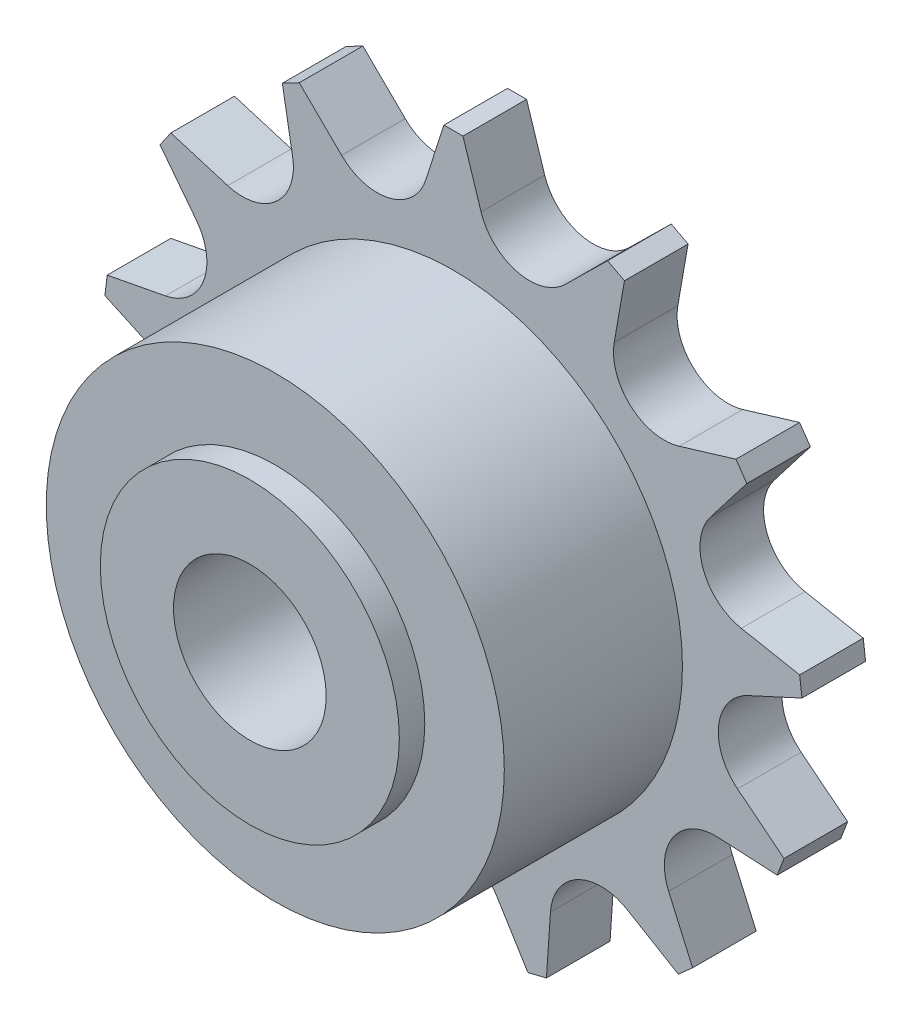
ISO-10303-21;
HEADER;
FILE_DESCRIPTION(('STEP AP214'),'2;1');
FILE_NAME('part.step','',(''),(''),'','','');
FILE_SCHEMA(('AUTOMOTIVE_DESIGN { 1 0 10303 214 1 1 1 1 }'));
ENDSEC;
DATA;
#1=APPLICATION_CONTEXT('core data for automotive mechanical design processes');
#2=APPLICATION_PROTOCOL_DEFINITION('international standard','automotive_design',2000,#1);
#3=PRODUCT_CONTEXT('',#1,'mechanical');
#4=PRODUCT('Part','Part','',(#3));
#5=PRODUCT_RELATED_PRODUCT_CATEGORY('part','',(#4));
#6=PRODUCT_DEFINITION_FORMATION('','',#4);
#7=PRODUCT_DEFINITION_CONTEXT('part definition',#1,'design');
#8=PRODUCT_DEFINITION('design','',#6,#7);
#9=PRODUCT_DEFINITION_SHAPE('','',#8);
#10=(LENGTH_UNIT() NAMED_UNIT(*) SI_UNIT(.MILLI.,.METRE.));
#11=(NAMED_UNIT(*) PLANE_ANGLE_UNIT() SI_UNIT($,.RADIAN.));
#12=(NAMED_UNIT(*) SI_UNIT($,.STERADIAN.) SOLID_ANGLE_UNIT());
#13=UNCERTAINTY_MEASURE_WITH_UNIT(LENGTH_MEASURE(1.E-05),#10,'distance_accuracy_value','');
#14=(GEOMETRIC_REPRESENTATION_CONTEXT(3) GLOBAL_UNCERTAINTY_ASSIGNED_CONTEXT((#13)) GLOBAL_UNIT_ASSIGNED_CONTEXT((#10,
#11,#12)) REPRESENTATION_CONTEXT('',''));
#15=CARTESIAN_POINT('',(0.,0.,0.));
#16=DIRECTION('',(0.,0.,1.));
#17=DIRECTION('',(1.,0.,0.));
#18=AXIS2_PLACEMENT_3D('',#15,#16,#17);
#19=CARTESIAN_POINT('',(0.,0.,-2.25));
#20=DIRECTION('',(0.,0.,1.));
#21=DIRECTION('',(1.,0.,0.));
#22=AXIS2_PLACEMENT_3D('',#19,#20,#21);
#23=PLANE('',#22);
#24=CARTESIAN_POINT('',(0.,0.,-2.25));
#25=DIRECTION('',(0.,0.,1.));
#26=DIRECTION('',(1.,0.,0.));
#27=AXIS2_PLACEMENT_3D('',#24,#25,#26);
#28=CIRCLE('',#27,3.);
#29=CARTESIAN_POINT('',(3.,0.,-2.25));
#30=VERTEX_POINT('',#29);
#31=EDGE_CURVE('E19',#30,#30,#28,.T.);
#32=ORIENTED_EDGE('',*,*,#31,.T.);
#33=EDGE_LOOP('',(#32));
#34=FACE_BOUND('',#33,.T.);
#35=CARTESIAN_POINT('',(0.,0.,-2.25));
#36=DIRECTION('',(0.,0.,-1.));
#37=DIRECTION('',(-1.,0.,0.));
#38=AXIS2_PLACEMENT_3D('',#35,#36,#37);
#39=CIRCLE('',#38,5.875);
#40=CARTESIAN_POINT('',(-5.875,0.,-2.25));
#41=VERTEX_POINT('',#40);
#42=EDGE_CURVE('E705',#41,#41,#39,.F.);
#43=ORIENTED_EDGE('',*,*,#42,.F.);
#44=EDGE_LOOP('',(#43));
#45=FACE_BOUND('',#44,.T.);
#46=ADVANCED_FACE('F16',(#34,#45),#23,.F.);
#47=CARTESIAN_POINT('',(0.,0.,0.));
#48=DIRECTION('',(0.,0.,1.));
#49=DIRECTION('',(1.,0.,0.));
#50=AXIS2_PLACEMENT_3D('',#47,#48,#49);
#51=CYLINDRICAL_SURFACE('',#50,3.);
#52=CARTESIAN_POINT('',(0.,0.,9.25));
#53=DIRECTION('',(0.,0.,1.));
#54=DIRECTION('',(1.,0.,0.));
#55=AXIS2_PLACEMENT_3D('',#52,#53,#54);
#56=CIRCLE('',#55,3.);
#57=CARTESIAN_POINT('',(3.,0.,9.25));
#58=VERTEX_POINT('',#57);
#59=EDGE_CURVE('E321',#58,#58,#56,.T.);
#60=ORIENTED_EDGE('',*,*,#59,.T.);
#61=EDGE_LOOP('',(#60));
#62=FACE_BOUND('',#61,.T.);
#63=ORIENTED_EDGE('',*,*,#31,.F.);
#64=EDGE_LOOP('',(#63));
#65=FACE_BOUND('',#64,.T.);
#66=ADVANCED_FACE('F714',(#62,#65),#51,.F.);
#67=CARTESIAN_POINT('',(0.,0.,-1.25));
#68=DIRECTION('',(0.,0.,-1.));
#69=DIRECTION('',(-1.,0.,0.));
#70=AXIS2_PLACEMENT_3D('',#67,#68,#69);
#71=CYLINDRICAL_SURFACE('',#70,5.875);
#72=CARTESIAN_POINT('',(0.,0.,-1.25));
#73=DIRECTION('',(0.,0.,-1.));
#74=DIRECTION('',(-1.,0.,0.));
#75=AXIS2_PLACEMENT_3D('',#72,#73,#74);
#76=CIRCLE('',#75,5.875);
#77=CARTESIAN_POINT('',(-5.875,0.,-1.25));
#78=VERTEX_POINT('',#77);
#79=EDGE_CURVE('E543',#78,#78,#76,.F.);
#80=ORIENTED_EDGE('',*,*,#79,.F.);
#81=EDGE_LOOP('',(#80));
#82=FACE_BOUND('',#81,.T.);
#83=ORIENTED_EDGE('',*,*,#42,.T.);
#84=EDGE_LOOP('',(#83));
#85=FACE_BOUND('',#84,.T.);
#86=ADVANCED_FACE('F716',(#82,#85),#71,.T.);
#87=CARTESIAN_POINT('',(0.,0.,9.25));
#88=DIRECTION('',(0.,0.,-1.));
#89=DIRECTION('',(-1.,0.,0.));
#90=AXIS2_PLACEMENT_3D('',#87,#88,#89);
#91=PLANE('',#90);
#92=ORIENTED_EDGE('',*,*,#59,.F.);
#93=EDGE_LOOP('',(#92));
#94=FACE_BOUND('',#93,.T.);
#95=CARTESIAN_POINT('',(0.,0.,9.25));
#96=DIRECTION('',(0.,0.,1.));
#97=DIRECTION('',(1.,0.,0.));
#98=AXIS2_PLACEMENT_3D('',#95,#96,#97);
#99=CIRCLE('',#98,5.875);
#100=CARTESIAN_POINT('',(5.875,0.,9.25));
#101=VERTEX_POINT('',#100);
#102=EDGE_CURVE('E528',#101,#101,#99,.F.);
#103=ORIENTED_EDGE('',*,*,#102,.F.);
#104=EDGE_LOOP('',(#103));
#105=FACE_BOUND('',#104,.T.);
#106=ADVANCED_FACE('F723',(#94,#105),#91,.F.);
#107=CARTESIAN_POINT('',(6.72198962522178,12.0007491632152,1.25));
#108=DIRECTION('',(0.464723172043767,0.885456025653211,0.));
#109=DIRECTION('',(-0.885456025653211,0.464723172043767,0.));
#110=AXIS2_PLACEMENT_3D('',#107,#108,#109);
#111=PLANE('',#110);
#112=DIRECTION('',(-0.885456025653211,0.464723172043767,0.));
#113=VECTOR('',#112,1.);
#114=CARTESIAN_POINT('',(6.72198962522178,12.0007491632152,1.25));
#115=LINE('',#114,#113);
#116=CARTESIAN_POINT('',(6.05789760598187,12.349291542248,1.25));
#117=VERTEX_POINT('',#116);
#118=CARTESIAN_POINT('',(6.72198962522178,12.0007491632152,1.25));
#119=VERTEX_POINT('',#118);
#120=EDGE_CURVE('E309',#117,#119,#115,.F.);
#121=ORIENTED_EDGE('',*,*,#120,.T.);
#122=DIRECTION('',(0.,0.,1.));
#123=VECTOR('',#122,1.);
#124=CARTESIAN_POINT('',(6.72198962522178,12.0007491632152,1.25));
#125=LINE('',#124,#123);
#126=CARTESIAN_POINT('',(6.72198962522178,12.0007491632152,-1.25));
#127=VERTEX_POINT('',#126);
#128=EDGE_CURVE('E523',#127,#119,#125,.T.);
#129=ORIENTED_EDGE('',*,*,#128,.F.);
#130=DIRECTION('',(0.885456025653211,-0.464723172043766,0.));
#131=VECTOR('',#130,1.);
#132=CARTESIAN_POINT('',(6.05789760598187,12.349291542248,-1.25));
#133=LINE('',#132,#131);
#134=CARTESIAN_POINT('',(6.05789760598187,12.349291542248,-1.25));
#135=VERTEX_POINT('',#134);
#136=EDGE_CURVE('E251',#135,#127,#133,.T.);
#137=ORIENTED_EDGE('',*,*,#136,.F.);
#138=DIRECTION('',(0.,0.,1.));
#139=VECTOR('',#138,1.);
#140=CARTESIAN_POINT('',(6.05789760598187,12.349291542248,1.25));
#141=LINE('',#140,#139);
#142=EDGE_CURVE('E324',#117,#135,#141,.F.);
#143=ORIENTED_EDGE('',*,*,#142,.F.);
#144=EDGE_LOOP('',(#121,#129,#137,#143));
#145=FACE_BOUND('',#144,.T.);
#146=ADVANCED_FACE('F325',(#145),#111,.T.);
#147=CARTESIAN_POINT('',(11.529052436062,7.50227131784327,1.25));
#148=DIRECTION('',(0.822983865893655,0.568064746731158,0.));
#149=DIRECTION('',(-0.568064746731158,0.822983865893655,0.));
#150=AXIS2_PLACEMENT_3D('',#147,#148,#149);
#151=PLANE('',#150);
#152=DIRECTION('',(-0.568064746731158,0.822983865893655,0.));
#153=VECTOR('',#152,1.);
#154=CARTESIAN_POINT('',(11.529052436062,7.50227131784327,1.25));
#155=LINE('',#154,#153);
#156=CARTESIAN_POINT('',(11.1030038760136,8.11950921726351,1.25));
#157=VERTEX_POINT('',#156);
#158=CARTESIAN_POINT('',(11.529052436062,7.50227131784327,1.25));
#159=VERTEX_POINT('',#158);
#160=EDGE_CURVE('E320',#157,#159,#155,.F.);
#161=ORIENTED_EDGE('',*,*,#160,.T.);
#162=DIRECTION('',(0.,0.,1.));
#163=VECTOR('',#162,1.);
#164=CARTESIAN_POINT('',(11.529052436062,7.50227131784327,1.25));
#165=LINE('',#164,#163);
#166=CARTESIAN_POINT('',(11.529052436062,7.50227131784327,-1.25));
#167=VERTEX_POINT('',#166);
#168=EDGE_CURVE('E509',#167,#159,#165,.T.);
#169=ORIENTED_EDGE('',*,*,#168,.F.);
#170=DIRECTION('',(0.568064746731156,-0.822983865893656,0.));
#171=VECTOR('',#170,1.);
#172=CARTESIAN_POINT('',(11.1030038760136,8.11950921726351,-1.25));
#173=LINE('',#172,#171);
#174=CARTESIAN_POINT('',(11.1030038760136,8.11950921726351,-1.25));
#175=VERTEX_POINT('',#174);
#176=EDGE_CURVE('E624',#175,#167,#173,.T.);
#177=ORIENTED_EDGE('',*,*,#176,.F.);
#178=DIRECTION('',(0.,0.,1.));
#179=VECTOR('',#178,1.);
#180=CARTESIAN_POINT('',(11.1030038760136,8.11950921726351,1.25));
#181=LINE('',#180,#179);
#182=EDGE_CURVE('E516',#157,#175,#181,.F.);
#183=ORIENTED_EDGE('',*,*,#182,.F.);
#184=EDGE_LOOP('',(#161,#169,#177,#183));
#185=FACE_BOUND('',#184,.T.);
#186=ADVANCED_FACE('F945',(#185),#151,.T.);
#187=CARTESIAN_POINT('',(13.694948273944,1.28511352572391,1.25));
#188=DIRECTION('',(0.992708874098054,0.120536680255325,0.));
#189=DIRECTION('',(-0.120536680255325,0.992708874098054,0.));
#190=AXIS2_PLACEMENT_3D('',#187,#188,#189);
#191=PLANE('',#190);
#192=DIRECTION('',(-0.120536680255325,0.992708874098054,0.));
#193=VECTOR('',#192,1.);
#194=CARTESIAN_POINT('',(13.694948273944,1.28511352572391,1.25));
#195=LINE('',#194,#193);
#196=CARTESIAN_POINT('',(13.6045457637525,2.02964518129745,1.25));
#197=VERTEX_POINT('',#196);
#198=CARTESIAN_POINT('',(13.694948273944,1.28511352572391,1.25));
#199=VERTEX_POINT('',#198);
#200=EDGE_CURVE('E613',#197,#199,#195,.F.);
#201=ORIENTED_EDGE('',*,*,#200,.T.);
#202=DIRECTION('',(0.,0.,1.));
#203=VECTOR('',#202,1.);
#204=CARTESIAN_POINT('',(13.694948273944,1.28511352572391,1.25));
#205=LINE('',#204,#203);
#206=CARTESIAN_POINT('',(13.694948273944,1.28511352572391,-1.25));
#207=VERTEX_POINT('',#206);
#208=EDGE_CURVE('E494',#207,#199,#205,.T.);
#209=ORIENTED_EDGE('',*,*,#208,.F.);
#210=DIRECTION('',(0.120536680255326,-0.992708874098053,0.));
#211=VECTOR('',#210,1.);
#212=CARTESIAN_POINT('',(13.6045457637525,2.02964518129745,-1.25));
#213=LINE('',#212,#211);
#214=CARTESIAN_POINT('',(13.6045457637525,2.02964518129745,-1.25));
#215=VERTEX_POINT('',#214);
#216=EDGE_CURVE('E616',#215,#207,#213,.T.);
#217=ORIENTED_EDGE('',*,*,#216,.F.);
#218=DIRECTION('',(0.,0.,1.));
#219=VECTOR('',#218,1.);
#220=CARTESIAN_POINT('',(13.6045457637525,2.02964518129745,1.25));
#221=LINE('',#220,#219);
#222=EDGE_CURVE('E501',#197,#215,#221,.F.);
#223=ORIENTED_EDGE('',*,*,#222,.F.);
#224=EDGE_LOOP('',(#201,#209,#217,#223));
#225=FACE_BOUND('',#224,.T.);
#226=ADVANCED_FACE('F941',(#225),#191,.T.);
#227=CARTESIAN_POINT('',(12.7234965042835,-5.2264482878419,1.25));
#228=DIRECTION('',(0.935016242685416,-0.354604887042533,0.));
#229=DIRECTION('',(0.354604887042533,0.935016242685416,0.));
#230=AXIS2_PLACEMENT_3D('',#227,#228,#229);
#231=PLANE('',#230);
#232=DIRECTION('',(0.354604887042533,0.935016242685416,0.));
#233=VECTOR('',#232,1.);
#234=CARTESIAN_POINT('',(12.7234965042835,-5.2264482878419,1.25));
#235=LINE('',#234,#233);
#236=CARTESIAN_POINT('',(12.9894501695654,-4.52518610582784,1.25));
#237=VERTEX_POINT('',#236);
#238=CARTESIAN_POINT('',(12.7234965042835,-5.2264482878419,1.25));
#239=VERTEX_POINT('',#238);
#240=EDGE_CURVE('E604',#237,#239,#235,.F.);
#241=ORIENTED_EDGE('',*,*,#240,.T.);
#242=DIRECTION('',(0.,0.,1.));
#243=VECTOR('',#242,1.);
#244=CARTESIAN_POINT('',(12.7234965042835,-5.2264482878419,1.25));
#245=LINE('',#244,#243);
#246=CARTESIAN_POINT('',(12.7234965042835,-5.2264482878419,-1.25));
#247=VERTEX_POINT('',#246);
#248=EDGE_CURVE('E479',#247,#239,#245,.T.);
#249=ORIENTED_EDGE('',*,*,#248,.F.);
#250=DIRECTION('',(-0.354604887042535,-0.935016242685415,0.));
#251=VECTOR('',#250,1.);
#252=CARTESIAN_POINT('',(12.9894501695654,-4.52518610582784,-1.25));
#253=LINE('',#252,#251);
#254=CARTESIAN_POINT('',(12.9894501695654,-4.52518610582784,-1.25));
#255=VERTEX_POINT('',#254);
#256=EDGE_CURVE('E607',#255,#247,#253,.T.);
#257=ORIENTED_EDGE('',*,*,#256,.F.);
#258=DIRECTION('',(0.,0.,1.));
#259=VECTOR('',#258,1.);
#260=CARTESIAN_POINT('',(12.9894501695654,-4.52518610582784,1.25));
#261=LINE('',#260,#259);
#262=EDGE_CURVE('E486',#237,#255,#261,.F.);
#263=ORIENTED_EDGE('',*,*,#262,.F.);
#264=EDGE_LOOP('',(#241,#249,#257,#263));
#265=FACE_BOUND('',#264,.T.);
#266=ADVANCED_FACE('F937',(#265),#231,.T.);
#267=CARTESIAN_POINT('',(8.83724502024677,-10.5406937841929,1.25));
#268=DIRECTION('',(0.663122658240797,-0.748510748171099,0.));
#269=DIRECTION('',(0.748510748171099,0.663122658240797,0.));
#270=AXIS2_PLACEMENT_3D('',#267,#268,#269);
#271=PLANE('',#270);
#272=DIRECTION('',(0.748510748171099,0.663122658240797,0.));
#273=VECTOR('',#272,1.);
#274=CARTESIAN_POINT('',(8.83724502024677,-10.5406937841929,1.25));
#275=LINE('',#274,#273);
#276=CARTESIAN_POINT('',(9.39862808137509,-10.0433517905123,1.25));
#277=VERTEX_POINT('',#276);
#278=CARTESIAN_POINT('',(8.83724502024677,-10.5406937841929,1.25));
#279=VERTEX_POINT('',#278);
#280=EDGE_CURVE('E595',#277,#279,#275,.F.);
#281=ORIENTED_EDGE('',*,*,#280,.T.);
#282=DIRECTION('',(0.,0.,1.));
#283=VECTOR('',#282,1.);
#284=CARTESIAN_POINT('',(8.83724502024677,-10.5406937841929,1.25));
#285=LINE('',#284,#283);
#286=CARTESIAN_POINT('',(8.83724502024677,-10.5406937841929,-1.25));
#287=VERTEX_POINT('',#286);
#288=EDGE_CURVE('E464',#287,#279,#285,.T.);
#289=ORIENTED_EDGE('',*,*,#288,.F.);
#290=DIRECTION('',(-0.7485107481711,-0.663122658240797,0.));
#291=VECTOR('',#290,1.);
#292=CARTESIAN_POINT('',(9.39862808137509,-10.0433517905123,-1.25));
#293=LINE('',#292,#291);
#294=CARTESIAN_POINT('',(9.39862808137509,-10.0433517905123,-1.25));
#295=VERTEX_POINT('',#294);
#296=EDGE_CURVE('E598',#295,#287,#293,.T.);
#297=ORIENTED_EDGE('',*,*,#296,.F.);
#298=DIRECTION('',(0.,0.,1.));
#299=VECTOR('',#298,1.);
#300=CARTESIAN_POINT('',(9.39862808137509,-10.0433517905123,1.25));
#301=LINE('',#300,#299);
#302=EDGE_CURVE('E471',#277,#295,#301,.F.);
#303=ORIENTED_EDGE('',*,*,#302,.F.);
#304=EDGE_LOOP('',(#281,#289,#297,#303));
#305=FACE_BOUND('',#304,.T.);
#306=ADVANCED_FACE('F933',(#305),#271,.T.);
#307=CARTESIAN_POINT('',(2.92648720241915,-13.4401933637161,1.25));
#308=DIRECTION('',(0.23931566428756,-0.970941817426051,0.));
#309=DIRECTION('',(0.970941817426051,0.23931566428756,0.));
#310=AXIS2_PLACEMENT_3D('',#307,#308,#309);
#311=PLANE('',#310);
#312=DIRECTION('',(0.970941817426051,0.23931566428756,0.));
#313=VECTOR('',#312,1.);
#314=CARTESIAN_POINT('',(2.92648720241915,-13.4401933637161,1.25));
#315=LINE('',#314,#313);
#316=CARTESIAN_POINT('',(3.65469356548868,-13.2607066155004,1.25));
#317=VERTEX_POINT('',#316);
#318=CARTESIAN_POINT('',(2.92648720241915,-13.4401933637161,1.25));
#319=VERTEX_POINT('',#318);
#320=EDGE_CURVE('E586',#317,#319,#315,.F.);
#321=ORIENTED_EDGE('',*,*,#320,.T.);
#322=DIRECTION('',(0.,0.,1.));
#323=VECTOR('',#322,1.);
#324=CARTESIAN_POINT('',(2.92648720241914,-13.4401933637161,1.25));
#325=LINE('',#324,#323);
#326=CARTESIAN_POINT('',(2.92648720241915,-13.4401933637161,-1.25));
#327=VERTEX_POINT('',#326);
#328=EDGE_CURVE('E449',#327,#319,#325,.T.);
#329=ORIENTED_EDGE('',*,*,#328,.F.);
#330=DIRECTION('',(-0.970941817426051,-0.239315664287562,0.));
#331=VECTOR('',#330,1.);
#332=CARTESIAN_POINT('',(3.65469356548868,-13.2607066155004,-1.25));
#333=LINE('',#332,#331);
#334=CARTESIAN_POINT('',(3.65469356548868,-13.2607066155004,-1.25));
#335=VERTEX_POINT('',#334);
#336=EDGE_CURVE('E589',#335,#327,#333,.T.);
#337=ORIENTED_EDGE('',*,*,#336,.F.);
#338=DIRECTION('',(0.,0.,1.));
#339=VECTOR('',#338,1.);
#340=CARTESIAN_POINT('',(3.65469356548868,-13.2607066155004,1.25));
#341=LINE('',#340,#339);
#342=EDGE_CURVE('E456',#317,#335,#341,.F.);
#343=ORIENTED_EDGE('',*,*,#342,.F.);
#344=EDGE_LOOP('',(#321,#329,#337,#343));
#345=FACE_BOUND('',#344,.T.);
#346=ADVANCED_FACE('F929',(#345),#311,.T.);
#347=CARTESIAN_POINT('',(-3.65469356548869,-13.2607066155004,1.25));
#348=DIRECTION('',(-0.239315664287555,-0.970941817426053,0.));
#349=DIRECTION('',(0.970941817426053,-0.239315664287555,0.));
#350=AXIS2_PLACEMENT_3D('',#347,#348,#349);
#351=PLANE('',#350);
#352=DIRECTION('',(0.970941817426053,-0.239315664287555,0.));
#353=VECTOR('',#352,1.);
#354=CARTESIAN_POINT('',(-3.65469356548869,-13.2607066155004,1.25));
#355=LINE('',#354,#353);
#356=CARTESIAN_POINT('',(-2.92648720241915,-13.4401933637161,1.25));
#357=VERTEX_POINT('',#356);
#358=CARTESIAN_POINT('',(-3.65469356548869,-13.2607066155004,1.25));
#359=VERTEX_POINT('',#358);
#360=EDGE_CURVE('E577',#357,#359,#355,.F.);
#361=ORIENTED_EDGE('',*,*,#360,.T.);
#362=DIRECTION('',(0.,0.,1.));
#363=VECTOR('',#362,1.);
#364=CARTESIAN_POINT('',(-3.65469356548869,-13.2607066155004,1.25));
#365=LINE('',#364,#363);
#366=CARTESIAN_POINT('',(-3.65469356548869,-13.2607066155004,-1.25));
#367=VERTEX_POINT('',#366);
#368=EDGE_CURVE('E434',#367,#359,#365,.T.);
#369=ORIENTED_EDGE('',*,*,#368,.F.);
#370=DIRECTION('',(-0.970941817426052,0.239315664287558,0.));
#371=VECTOR('',#370,1.);
#372=CARTESIAN_POINT('',(-2.92648720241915,-13.4401933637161,-1.25));
#373=LINE('',#372,#371);
#374=CARTESIAN_POINT('',(-2.92648720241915,-13.4401933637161,-1.25));
#375=VERTEX_POINT('',#374);
#376=EDGE_CURVE('E580',#375,#367,#373,.T.);
#377=ORIENTED_EDGE('',*,*,#376,.F.);
#378=DIRECTION('',(0.,0.,1.));
#379=VECTOR('',#378,1.);
#380=CARTESIAN_POINT('',(-2.92648720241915,-13.4401933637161,1.25));
#381=LINE('',#380,#379);
#382=EDGE_CURVE('E441',#357,#375,#381,.F.);
#383=ORIENTED_EDGE('',*,*,#382,.F.);
#384=EDGE_LOOP('',(#361,#369,#377,#383));
#385=FACE_BOUND('',#384,.T.);
#386=ADVANCED_FACE('F925',(#385),#351,.T.);
#387=CARTESIAN_POINT('',(-9.3986280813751,-10.0433517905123,1.25));
#388=DIRECTION('',(-0.663122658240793,-0.748510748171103,0.));
#389=DIRECTION('',(0.748510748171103,-0.663122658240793,0.));
#390=AXIS2_PLACEMENT_3D('',#387,#388,#389);
#391=PLANE('',#390);
#392=DIRECTION('',(0.748510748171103,-0.663122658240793,0.));
#393=VECTOR('',#392,1.);
#394=CARTESIAN_POINT('',(-9.3986280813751,-10.0433517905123,1.25));
#395=LINE('',#394,#393);
#396=CARTESIAN_POINT('',(-8.83724502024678,-10.5406937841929,1.25));
#397=VERTEX_POINT('',#396);
#398=CARTESIAN_POINT('',(-9.3986280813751,-10.0433517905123,1.25));
#399=VERTEX_POINT('',#398);
#400=EDGE_CURVE('E568',#397,#399,#395,.F.);
#401=ORIENTED_EDGE('',*,*,#400,.T.);
#402=DIRECTION('',(0.,0.,1.));
#403=VECTOR('',#402,1.);
#404=CARTESIAN_POINT('',(-9.3986280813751,-10.0433517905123,1.25));
#405=LINE('',#404,#403);
#406=CARTESIAN_POINT('',(-9.3986280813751,-10.0433517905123,-1.25));
#407=VERTEX_POINT('',#406);
#408=EDGE_CURVE('E419',#407,#399,#405,.T.);
#409=ORIENTED_EDGE('',*,*,#408,.F.);
#410=DIRECTION('',(-0.748510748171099,0.663122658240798,0.));
#411=VECTOR('',#410,1.);
#412=CARTESIAN_POINT('',(-8.83724502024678,-10.5406937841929,-1.25));
#413=LINE('',#412,#411);
#414=CARTESIAN_POINT('',(-8.83724502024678,-10.5406937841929,-1.25));
#415=VERTEX_POINT('',#414);
#416=EDGE_CURVE('E571',#415,#407,#413,.T.);
#417=ORIENTED_EDGE('',*,*,#416,.F.);
#418=DIRECTION('',(0.,0.,1.));
#419=VECTOR('',#418,1.);
#420=CARTESIAN_POINT('',(-8.83724502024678,-10.5406937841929,1.25));
#421=LINE('',#420,#419);
#422=EDGE_CURVE('E426',#397,#415,#421,.F.);
#423=ORIENTED_EDGE('',*,*,#422,.F.);
#424=EDGE_LOOP('',(#401,#409,#417,#423));
#425=FACE_BOUND('',#424,.T.);
#426=ADVANCED_FACE('F921',(#425),#391,.T.);
#427=CARTESIAN_POINT('',(-12.9894501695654,-4.52518610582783,1.25));
#428=DIRECTION('',(-0.935016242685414,-0.354604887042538,0.));
#429=DIRECTION('',(0.354604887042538,-0.935016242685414,0.));
#430=AXIS2_PLACEMENT_3D('',#427,#428,#429);
#431=PLANE('',#430);
#432=DIRECTION('',(0.354604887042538,-0.935016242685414,0.));
#433=VECTOR('',#432,1.);
#434=CARTESIAN_POINT('',(-12.9894501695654,-4.52518610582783,1.25));
#435=LINE('',#434,#433);
#436=CARTESIAN_POINT('',(-12.7234965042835,-5.22644828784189,1.25));
#437=VERTEX_POINT('',#436);
#438=CARTESIAN_POINT('',(-12.9894501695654,-4.52518610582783,1.25));
#439=VERTEX_POINT('',#438);
#440=EDGE_CURVE('E559',#437,#439,#435,.F.);
#441=ORIENTED_EDGE('',*,*,#440,.T.);
#442=DIRECTION('',(0.,0.,1.));
#443=VECTOR('',#442,1.);
#444=CARTESIAN_POINT('',(-12.9894501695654,-4.52518610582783,1.25));
#445=LINE('',#444,#443);
#446=CARTESIAN_POINT('',(-12.9894501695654,-4.52518610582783,-1.25));
#447=VERTEX_POINT('',#446);
#448=EDGE_CURVE('E404',#447,#439,#445,.T.);
#449=ORIENTED_EDGE('',*,*,#448,.F.);
#450=DIRECTION('',(-0.354604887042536,0.935016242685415,0.));
#451=VECTOR('',#450,1.);
#452=CARTESIAN_POINT('',(-12.7234965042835,-5.22644828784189,-1.25));
#453=LINE('',#452,#451);
#454=CARTESIAN_POINT('',(-12.7234965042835,-5.22644828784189,-1.25));
#455=VERTEX_POINT('',#454);
#456=EDGE_CURVE('E562',#455,#447,#453,.T.);
#457=ORIENTED_EDGE('',*,*,#456,.F.);
#458=DIRECTION('',(0.,0.,1.));
#459=VECTOR('',#458,1.);
#460=CARTESIAN_POINT('',(-12.7234965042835,-5.22644828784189,1.25));
#461=LINE('',#460,#459);
#462=EDGE_CURVE('E411',#437,#455,#461,.F.);
#463=ORIENTED_EDGE('',*,*,#462,.F.);
#464=EDGE_LOOP('',(#441,#449,#457,#463));
#465=FACE_BOUND('',#464,.T.);
#466=ADVANCED_FACE('F917',(#465),#431,.T.);
#467=CARTESIAN_POINT('',(-13.6045457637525,2.02964518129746,1.25));
#468=DIRECTION('',(-0.992708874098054,0.12053668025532,0.));
#469=DIRECTION('',(-0.12053668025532,-0.992708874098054,0.));
#470=AXIS2_PLACEMENT_3D('',#467,#468,#469);
#471=PLANE('',#470);
#472=DIRECTION('',(-0.12053668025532,-0.992708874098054,0.));
#473=VECTOR('',#472,1.);
#474=CARTESIAN_POINT('',(-13.6045457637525,2.02964518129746,1.25));
#475=LINE('',#474,#473);
#476=CARTESIAN_POINT('',(-13.694948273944,1.28511352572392,1.25));
#477=VERTEX_POINT('',#476);
#478=CARTESIAN_POINT('',(-13.6045457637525,2.02964518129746,1.25));
#479=VERTEX_POINT('',#478);
#480=EDGE_CURVE('E550',#477,#479,#475,.F.);
#481=ORIENTED_EDGE('',*,*,#480,.T.);
#482=DIRECTION('',(0.,0.,1.));
#483=VECTOR('',#482,1.);
#484=CARTESIAN_POINT('',(-13.6045457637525,2.02964518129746,1.25));
#485=LINE('',#484,#483);
#486=CARTESIAN_POINT('',(-13.6045457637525,2.02964518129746,-1.25));
#487=VERTEX_POINT('',#486);
#488=EDGE_CURVE('E389',#487,#479,#485,.T.);
#489=ORIENTED_EDGE('',*,*,#488,.F.);
#490=DIRECTION('',(0.120536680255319,0.992708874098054,0.));
#491=VECTOR('',#490,1.);
#492=CARTESIAN_POINT('',(-13.694948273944,1.28511352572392,-1.25));
#493=LINE('',#492,#491);
#494=CARTESIAN_POINT('',(-13.694948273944,1.28511352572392,-1.25));
#495=VERTEX_POINT('',#494);
#496=EDGE_CURVE('E553',#495,#487,#493,.T.);
#497=ORIENTED_EDGE('',*,*,#496,.F.);
#498=DIRECTION('',(0.,0.,1.));
#499=VECTOR('',#498,1.);
#500=CARTESIAN_POINT('',(-13.694948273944,1.28511352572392,1.25));
#501=LINE('',#500,#499);
#502=EDGE_CURVE('E396',#477,#495,#501,.F.);
#503=ORIENTED_EDGE('',*,*,#502,.F.);
#504=EDGE_LOOP('',(#481,#489,#497,#503));
#505=FACE_BOUND('',#504,.T.);
#506=ADVANCED_FACE('F913',(#505),#471,.T.);
#507=CARTESIAN_POINT('',(-11.1030038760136,8.11950921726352,1.25));
#508=DIRECTION('',(-0.822983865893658,0.568064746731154,0.));
#509=DIRECTION('',(-0.568064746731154,-0.822983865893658,0.));
#510=AXIS2_PLACEMENT_3D('',#507,#508,#509);
#511=PLANE('',#510);
#512=DIRECTION('',(-0.568064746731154,-0.822983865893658,0.));
#513=VECTOR('',#512,1.);
#514=CARTESIAN_POINT('',(-11.1030038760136,8.11950921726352,1.25));
#515=LINE('',#514,#513);
#516=CARTESIAN_POINT('',(-11.529052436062,7.50227131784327,1.25));
#517=VERTEX_POINT('',#516);
#518=CARTESIAN_POINT('',(-11.1030038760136,8.11950921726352,1.25));
#519=VERTEX_POINT('',#518);
#520=EDGE_CURVE('E539',#517,#519,#515,.F.);
#521=ORIENTED_EDGE('',*,*,#520,.T.);
#522=DIRECTION('',(0.,0.,1.));
#523=VECTOR('',#522,1.);
#524=CARTESIAN_POINT('',(-11.1030038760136,8.11950921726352,1.25));
#525=LINE('',#524,#523);
#526=CARTESIAN_POINT('',(-11.1030038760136,8.11950921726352,-1.25));
#527=VERTEX_POINT('',#526);
#528=EDGE_CURVE('E374',#527,#519,#525,.T.);
#529=ORIENTED_EDGE('',*,*,#528,.F.);
#530=DIRECTION('',(0.568064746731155,0.822983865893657,0.));
#531=VECTOR('',#530,1.);
#532=CARTESIAN_POINT('',(-11.529052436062,7.50227131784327,-1.25));
#533=LINE('',#532,#531);
#534=CARTESIAN_POINT('',(-11.529052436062,7.50227131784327,-1.25));
#535=VERTEX_POINT('',#534);
#536=EDGE_CURVE('E544',#535,#527,#533,.T.);
#537=ORIENTED_EDGE('',*,*,#536,.F.);
#538=DIRECTION('',(0.,0.,1.));
#539=VECTOR('',#538,1.);
#540=CARTESIAN_POINT('',(-11.529052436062,7.50227131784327,1.25));
#541=LINE('',#540,#539);
#542=EDGE_CURVE('E381',#517,#535,#541,.F.);
#543=ORIENTED_EDGE('',*,*,#542,.F.);
#544=EDGE_LOOP('',(#521,#529,#537,#543));
#545=FACE_BOUND('',#544,.T.);
#546=ADVANCED_FACE('F909',(#545),#511,.T.);
#547=CARTESIAN_POINT('',(-6.05789760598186,12.3492915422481,1.25));
#548=DIRECTION('',(-0.464723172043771,0.885456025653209,0.));
#549=DIRECTION('',(-0.885456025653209,-0.464723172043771,0.));
#550=AXIS2_PLACEMENT_3D('',#547,#548,#549);
#551=PLANE('',#550);
#552=DIRECTION('',(-0.885456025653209,-0.464723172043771,0.));
#553=VECTOR('',#552,1.);
#554=CARTESIAN_POINT('',(-6.05789760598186,12.3492915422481,1.25));
#555=LINE('',#554,#553);
#556=CARTESIAN_POINT('',(-6.72198962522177,12.0007491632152,1.25));
#557=VERTEX_POINT('',#556);
#558=CARTESIAN_POINT('',(-6.05789760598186,12.3492915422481,1.25));
#559=VERTEX_POINT('',#558);
#560=EDGE_CURVE('E532',#557,#559,#555,.F.);
#561=ORIENTED_EDGE('',*,*,#560,.T.);
#562=DIRECTION('',(0.,0.,1.));
#563=VECTOR('',#562,1.);
#564=CARTESIAN_POINT('',(-6.05789760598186,12.349291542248,1.25));
#565=LINE('',#564,#563);
#566=CARTESIAN_POINT('',(-6.05789760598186,12.3492915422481,-1.25));
#567=VERTEX_POINT('',#566);
#568=EDGE_CURVE('E359',#567,#559,#565,.T.);
#569=ORIENTED_EDGE('',*,*,#568,.F.);
#570=DIRECTION('',(0.88545602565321,0.464723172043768,0.));
#571=VECTOR('',#570,1.);
#572=CARTESIAN_POINT('',(-6.72198962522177,12.0007491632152,-1.25));
#573=LINE('',#572,#571);
#574=CARTESIAN_POINT('',(-6.72198962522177,12.0007491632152,-1.25));
#575=VERTEX_POINT('',#574);
#576=EDGE_CURVE('E540',#575,#567,#573,.T.);
#577=ORIENTED_EDGE('',*,*,#576,.F.);
#578=DIRECTION('',(0.,0.,1.));
#579=VECTOR('',#578,1.);
#580=CARTESIAN_POINT('',(-6.72198962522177,12.0007491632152,1.25));
#581=LINE('',#580,#579);
#582=EDGE_CURVE('E366',#557,#575,#581,.F.);
#583=ORIENTED_EDGE('',*,*,#582,.F.);
#584=EDGE_LOOP('',(#561,#569,#577,#583));
#585=FACE_BOUND('',#584,.T.);
#586=ADVANCED_FACE('F905',(#585),#551,.T.);
#587=CARTESIAN_POINT('',(0.375,13.75,1.25));
#588=DIRECTION('',(0.,1.,0.));
#589=DIRECTION('',(0.,0.,1.));
#590=AXIS2_PLACEMENT_3D('',#587,#588,#589);
#591=PLANE('',#590);
#592=DIRECTION('',(1.,0.,0.));
#593=VECTOR('',#592,1.);
#594=CARTESIAN_POINT('',(0.375,13.75,1.25));
#595=LINE('',#594,#593);
#596=CARTESIAN_POINT('',(-0.375,13.75,1.25));
#597=VERTEX_POINT('',#596);
#598=CARTESIAN_POINT('',(0.375,13.75,1.25));
#599=VERTEX_POINT('',#598);
#600=EDGE_CURVE('E529',#597,#599,#595,.T.);
#601=ORIENTED_EDGE('',*,*,#600,.T.);
#602=DIRECTION('',(0.,0.,1.));
#603=VECTOR('',#602,1.);
#604=CARTESIAN_POINT('',(0.375,13.75,1.25));
#605=LINE('',#604,#603);
#606=CARTESIAN_POINT('',(0.375,13.75,-1.25));
#607=VERTEX_POINT('',#606);
#608=EDGE_CURVE('E344',#607,#599,#605,.T.);
#609=ORIENTED_EDGE('',*,*,#608,.F.);
#610=DIRECTION('',(-1.,0.,0.));
#611=VECTOR('',#610,1.);
#612=CARTESIAN_POINT('',(0.,13.75,-1.25));
#613=LINE('',#612,#611);
#614=CARTESIAN_POINT('',(-0.375,13.75,-1.25));
#615=VERTEX_POINT('',#614);
#616=EDGE_CURVE('E531',#615,#607,#613,.F.);
#617=ORIENTED_EDGE('',*,*,#616,.F.);
#618=DIRECTION('',(0.,0.,1.));
#619=VECTOR('',#618,1.);
#620=CARTESIAN_POINT('',(-0.375,13.75,1.25));
#621=LINE('',#620,#619);
#622=EDGE_CURVE('E351',#597,#615,#621,.F.);
#623=ORIENTED_EDGE('',*,*,#622,.F.);
#624=EDGE_LOOP('',(#601,#609,#617,#623));
#625=FACE_BOUND('',#624,.T.);
#626=ADVANCED_FACE('F901',(#625),#591,.T.);
#627=CARTESIAN_POINT('',(0.,0.,-1.25));
#628=DIRECTION('',(0.,0.,-1.));
#629=DIRECTION('',(-1.,0.,0.));
#630=AXIS2_PLACEMENT_3D('',#627,#628,#629);
#631=PLANE('',#630);
#632=ORIENTED_EDGE('',*,*,#79,.T.);
#633=EDGE_LOOP('',(#632));
#634=FACE_BOUND('',#633,.T.);
#635=ORIENTED_EDGE('',*,*,#576,.T.);
#636=DIRECTION('',(-0.712567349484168,0.701603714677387,0.));
#637=VECTOR('',#636,1.);
#638=CARTESIAN_POINT('',(-4.39465323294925,10.7116380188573,-1.25));
#639=LINE('',#638,#637);
#640=CARTESIAN_POINT('',(-4.39465323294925,10.7116380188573,-1.25));
#641=VERTEX_POINT('',#640);
#642=EDGE_CURVE('E362',#641,#567,#639,.T.);
#643=ORIENTED_EDGE('',*,*,#642,.F.);
#644=CARTESIAN_POINT('',(-2.99144580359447,12.1367727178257,-1.25));
#645=DIRECTION('',(0.,0.,-1.));
#646=DIRECTION('',(-1.,0.,0.));
#647=AXIS2_PLACEMENT_3D('',#644,#645,#646);
#648=CIRCLE('',#647,2.);
#649=CARTESIAN_POINT('',(-1.08667421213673,11.5269816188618,-1.25));
#650=VERTEX_POINT('',#649);
#651=EDGE_CURVE('E358',#641,#650,#648,.F.);
#652=ORIENTED_EDGE('',*,*,#651,.T.);
#653=DIRECTION('',(-0.304895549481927,-0.952385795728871,0.));
#654=VECTOR('',#653,1.);
#655=CARTESIAN_POINT('',(-0.375,13.75,-1.25));
#656=LINE('',#655,#654);
#657=EDGE_CURVE('E352',#615,#650,#656,.T.);
#658=ORIENTED_EDGE('',*,*,#657,.F.);
#659=ORIENTED_EDGE('',*,*,#616,.T.);
#660=DIRECTION('',(-0.304895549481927,0.952385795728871,0.));
#661=VECTOR('',#660,1.);
#662=CARTESIAN_POINT('',(1.08667421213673,11.5269816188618,-1.25));
#663=LINE('',#662,#661);
#664=CARTESIAN_POINT('',(1.08667421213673,11.5269816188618,-1.25));
#665=VERTEX_POINT('',#664);
#666=EDGE_CURVE('E347',#665,#607,#663,.T.);
#667=ORIENTED_EDGE('',*,*,#666,.F.);
#668=CARTESIAN_POINT('',(2.99144580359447,12.1367727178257,-1.25));
#669=DIRECTION('',(0.,0.,-1.));
#670=DIRECTION('',(-1.,0.,0.));
#671=AXIS2_PLACEMENT_3D('',#668,#669,#670);
#672=CIRCLE('',#671,2.);
#673=CARTESIAN_POINT('',(4.39465323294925,10.7116380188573,-1.25));
#674=VERTEX_POINT('',#673);
#675=EDGE_CURVE('E338',#665,#674,#672,.F.);
#676=ORIENTED_EDGE('',*,*,#675,.T.);
#677=DIRECTION('',(-0.712567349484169,-0.701603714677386,0.));
#678=VECTOR('',#677,1.);
#679=CARTESIAN_POINT('',(6.05789760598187,12.349291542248,-1.25));
#680=LINE('',#679,#678);
#681=EDGE_CURVE('E327',#135,#674,#680,.T.);
#682=ORIENTED_EDGE('',*,*,#681,.F.);
#683=ORIENTED_EDGE('',*,*,#136,.T.);
#684=DIRECTION('',(0.172624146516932,0.984987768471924,0.));
#685=VECTOR('',#684,1.);
#686=CARTESIAN_POINT('',(6.3190576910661,9.70163264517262,-1.25));
#687=LINE('',#686,#685);
#688=CARTESIAN_POINT('',(6.3190576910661,9.70163264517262,-1.25));
#689=VERTEX_POINT('',#688);
#690=EDGE_CURVE('E243',#689,#127,#687,.T.);
#691=ORIENTED_EDGE('',*,*,#690,.F.);
#692=CARTESIAN_POINT('',(8.28903322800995,9.35638435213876,-1.25));
#693=DIRECTION('',(0.,0.,-1.));
#694=DIRECTION('',(-1.,0.,0.));
#695=AXIS2_PLACEMENT_3D('',#692,#693,#694);
#696=CIRCLE('',#695,2.);
#697=CARTESIAN_POINT('',(8.86921858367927,7.44238723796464,-1.25));
#698=VERTEX_POINT('',#697);
#699=EDGE_CURVE('E522',#689,#698,#696,.F.);
#700=ORIENTED_EDGE('',*,*,#699,.T.);
#701=DIRECTION('',(-0.95699855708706,-0.290092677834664,0.));
#702=VECTOR('',#701,1.);
#703=CARTESIAN_POINT('',(11.1030038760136,8.11950921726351,-1.25));
#704=LINE('',#703,#702);
#705=EDGE_CURVE('E517',#175,#698,#704,.T.);
#706=ORIENTED_EDGE('',*,*,#705,.F.);
#707=ORIENTED_EDGE('',*,*,#176,.T.);
#708=DIRECTION('',(0.610597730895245,0.791940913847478,0.));
#709=VECTOR('',#708,1.);
#710=CARTESIAN_POINT('',(10.1038212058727,5.65375654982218,-1.25));
#711=LINE('',#710,#709);
#712=CARTESIAN_POINT('',(10.1038212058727,5.65375654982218,-1.25));
#713=VERTEX_POINT('',#712);
#714=EDGE_CURVE('E512',#713,#167,#711,.T.);
#715=ORIENTED_EDGE('',*,*,#714,.F.);
#716=CARTESIAN_POINT('',(11.6877030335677,4.43256108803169,-1.25));
#717=DIRECTION('',(0.,0.,-1.));
#718=DIRECTION('',(-1.,0.,0.));
#719=AXIS2_PLACEMENT_3D('',#716,#717,#718);
#720=CIRCLE('',#719,2.);
#721=CARTESIAN_POINT('',(11.3119528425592,2.46817523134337,-1.25));
#722=VERTEX_POINT('',#721);
#723=EDGE_CURVE('E508',#713,#722,#720,.F.);
#724=ORIENTED_EDGE('',*,*,#723,.T.);
#725=DIRECTION('',(-0.98219292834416,0.18787509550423,0.));
#726=VECTOR('',#725,1.);
#727=CARTESIAN_POINT('',(13.6045457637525,2.02964518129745,-1.25));
#728=LINE('',#727,#726);
#729=EDGE_CURVE('E502',#215,#722,#728,.T.);
#730=ORIENTED_EDGE('',*,*,#729,.F.);
#731=ORIENTED_EDGE('',*,*,#216,.T.);
#732=DIRECTION('',(0.908690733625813,0.417469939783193,0.));
#733=VECTOR('',#732,1.);
#734=CARTESIAN_POINT('',(11.5739210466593,0.310672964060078,-1.25));
#735=LINE('',#734,#733);
#736=CARTESIAN_POINT('',(11.5739210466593,0.310672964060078,-1.25));
#737=VERTEX_POINT('',#736);
#738=EDGE_CURVE('E497',#737,#207,#735,.T.);
#739=ORIENTED_EDGE('',*,*,#738,.F.);
#740=CARTESIAN_POINT('',(12.4088609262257,-1.50670850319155,-1.25));
#741=DIRECTION('',(0.,0.,-1.));
#742=DIRECTION('',(-1.,0.,0.));
#743=AXIS2_PLACEMENT_3D('',#740,#741,#742);
#744=CIRCLE('',#743,2.);
#745=CARTESIAN_POINT('',(11.1632550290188,-3.07146597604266,-1.25));
#746=VERTEX_POINT('',#745);
#747=EDGE_CURVE('E493',#737,#746,#744,.F.);
#748=ORIENTED_EDGE('',*,*,#747,.T.);
#749=DIRECTION('',(-0.782378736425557,0.622802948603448,0.));
#750=VECTOR('',#749,1.);
#751=CARTESIAN_POINT('',(12.9894501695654,-4.52518610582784,-1.25));
#752=LINE('',#751,#750);
#753=EDGE_CURVE('E487',#255,#746,#752,.T.);
#754=ORIENTED_EDGE('',*,*,#753,.F.);
#755=ORIENTED_EDGE('',*,*,#256,.T.);
#756=DIRECTION('',(0.998613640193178,-0.052638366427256,0.));
#757=VECTOR('',#756,1.);
#758=CARTESIAN_POINT('',(10.3925750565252,-5.10358205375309,-1.25));
#759=LINE('',#758,#757);
#760=CARTESIAN_POINT('',(10.3925750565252,-5.10358205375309,-1.25));
#761=VERTEX_POINT('',#760);
#762=EDGE_CURVE('E482',#761,#247,#759,.T.);
#763=ORIENTED_EDGE('',*,*,#762,.F.);
#764=CARTESIAN_POINT('',(10.2872983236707,-7.10080933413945,-1.25));
#765=DIRECTION('',(0.,0.,-1.));
#766=DIRECTION('',(-1.,0.,0.));
#767=AXIS2_PLACEMENT_3D('',#764,#765,#766);
#768=CIRCLE('',#767,2.);
#769=CARTESIAN_POINT('',(8.45719002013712,-7.90747134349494,-1.25));
#770=VERTEX_POINT('',#769);
#771=EDGE_CURVE('E478',#761,#770,#768,.F.);
#772=ORIENTED_EDGE('',*,*,#771,.T.);
#773=DIRECTION('',(-0.403331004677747,0.91505415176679,0.));
#774=VECTOR('',#773,1.);
#775=CARTESIAN_POINT('',(9.39862808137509,-10.0433517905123,-1.25));
#776=LINE('',#775,#774);
#777=EDGE_CURVE('E472',#295,#770,#776,.T.);
#778=ORIENTED_EDGE('',*,*,#777,.F.);
#779=ORIENTED_EDGE('',*,*,#296,.T.);
#780=DIRECTION('',(0.85976619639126,-0.510687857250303,0.));
#781=VECTOR('',#780,1.);
#782=CARTESIAN_POINT('',(6.83041536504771,-9.34866792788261,-1.25));
#783=LINE('',#782,#781);
#784=CARTESIAN_POINT('',(6.83041536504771,-9.34866792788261,-1.25));
#785=VERTEX_POINT('',#784);
#786=EDGE_CURVE('E467',#785,#287,#783,.T.);
#787=ORIENTED_EDGE('',*,*,#786,.F.);
#788=CARTESIAN_POINT('',(5.80903965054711,-11.0682003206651,-1.25));
#789=DIRECTION('',(0.,0.,-1.));
#790=DIRECTION('',(-1.,0.,0.));
#791=AXIS2_PLACEMENT_3D('',#788,#789,#790);
#792=CIRCLE('',#791,2.);
#793=CARTESIAN_POINT('',(3.81368469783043,-10.9319703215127,-1.25));
#794=VERTEX_POINT('',#793);
#795=EDGE_CURVE('E463',#785,#794,#792,.F.);
#796=ORIENTED_EDGE('',*,*,#795,.T.);
#797=DIRECTION('',(0.068114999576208,0.997677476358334,0.));
#798=VECTOR('',#797,1.);
#799=CARTESIAN_POINT('',(3.65469356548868,-13.2607066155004,-1.25));
#800=LINE('',#799,#798);
#801=EDGE_CURVE('E457',#335,#794,#800,.T.);
#802=ORIENTED_EDGE('',*,*,#801,.F.);
#803=ORIENTED_EDGE('',*,*,#336,.T.);
#804=DIRECTION('',(0.523956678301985,-0.851744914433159,0.));
#805=VECTOR('',#804,1.);
#806=CARTESIAN_POINT('',(1.70348982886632,-11.452086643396,-1.25));
#807=LINE('',#806,#805);
#808=CARTESIAN_POINT('',(1.70348982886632,-11.452086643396,-1.25));
#809=VERTEX_POINT('',#808);
#810=EDGE_CURVE('E452',#809,#327,#807,.T.);
#811=ORIENTED_EDGE('',*,*,#810,.F.);
#812=CARTESIAN_POINT('',(0.,-12.5,-1.25));
#813=DIRECTION('',(0.,0.,-1.));
#814=DIRECTION('',(-1.,0.,0.));
#815=AXIS2_PLACEMENT_3D('',#812,#813,#814);
#816=CIRCLE('',#815,2.);
#817=CARTESIAN_POINT('',(-1.70348982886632,-11.452086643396,-1.25));
#818=VERTEX_POINT('',#817);
#819=EDGE_CURVE('E448',#809,#818,#816,.F.);
#820=ORIENTED_EDGE('',*,*,#819,.T.);
#821=DIRECTION('',(0.523956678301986,0.851744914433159,0.));
#822=VECTOR('',#821,1.);
#823=CARTESIAN_POINT('',(-2.92648720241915,-13.4401933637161,-1.25));
#824=LINE('',#823,#822);
#825=EDGE_CURVE('E442',#375,#818,#824,.T.);
#826=ORIENTED_EDGE('',*,*,#825,.F.);
#827=ORIENTED_EDGE('',*,*,#376,.T.);
#828=DIRECTION('',(0.068114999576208,-0.997677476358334,0.));
#829=VECTOR('',#828,1.);
#830=CARTESIAN_POINT('',(-3.81368469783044,-10.9319703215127,-1.25));
#831=LINE('',#830,#829);
#832=CARTESIAN_POINT('',(-3.81368469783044,-10.9319703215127,-1.25));
#833=VERTEX_POINT('',#832);
#834=EDGE_CURVE('E437',#833,#367,#831,.T.);
#835=ORIENTED_EDGE('',*,*,#834,.F.);
#836=CARTESIAN_POINT('',(-5.80903965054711,-11.0682003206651,-1.25));
#837=DIRECTION('',(0.,0.,-1.));
#838=DIRECTION('',(-1.,0.,0.));
#839=AXIS2_PLACEMENT_3D('',#836,#837,#838);
#840=CIRCLE('',#839,2.);
#841=CARTESIAN_POINT('',(-6.83041536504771,-9.3486679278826,-1.25));
#842=VERTEX_POINT('',#841);
#843=EDGE_CURVE('E433',#833,#842,#840,.F.);
#844=ORIENTED_EDGE('',*,*,#843,.T.);
#845=DIRECTION('',(0.85976619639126,0.510687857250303,0.));
#846=VECTOR('',#845,1.);
#847=CARTESIAN_POINT('',(-8.83724502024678,-10.5406937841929,-1.25));
#848=LINE('',#847,#846);
#849=EDGE_CURVE('E427',#415,#842,#848,.T.);
#850=ORIENTED_EDGE('',*,*,#849,.F.);
#851=ORIENTED_EDGE('',*,*,#416,.T.);
#852=DIRECTION('',(-0.403331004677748,-0.915054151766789,0.));
#853=VECTOR('',#852,1.);
#854=CARTESIAN_POINT('',(-8.45719002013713,-7.90747134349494,-1.25));
#855=LINE('',#854,#853);
#856=CARTESIAN_POINT('',(-8.45719002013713,-7.90747134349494,-1.25));
#857=VERTEX_POINT('',#856);
#858=EDGE_CURVE('E422',#857,#407,#855,.T.);
#859=ORIENTED_EDGE('',*,*,#858,.F.);
#860=CARTESIAN_POINT('',(-10.2872983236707,-7.10080933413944,-1.25));
#861=DIRECTION('',(0.,0.,-1.));
#862=DIRECTION('',(-1.,0.,0.));
#863=AXIS2_PLACEMENT_3D('',#860,#861,#862);
#864=CIRCLE('',#863,2.);
#865=CARTESIAN_POINT('',(-10.3925750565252,-5.10358205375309,-1.25));
#866=VERTEX_POINT('',#865);
#867=EDGE_CURVE('E418',#857,#866,#864,.F.);
#868=ORIENTED_EDGE('',*,*,#867,.T.);
#869=DIRECTION('',(0.998613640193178,0.052638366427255,0.));
#870=VECTOR('',#869,1.);
#871=CARTESIAN_POINT('',(-12.7234965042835,-5.22644828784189,-1.25));
#872=LINE('',#871,#870);
#873=EDGE_CURVE('E412',#455,#866,#872,.T.);
#874=ORIENTED_EDGE('',*,*,#873,.F.);
#875=ORIENTED_EDGE('',*,*,#456,.T.);
#876=DIRECTION('',(-0.782378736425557,-0.622802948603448,0.));
#877=VECTOR('',#876,1.);
#878=CARTESIAN_POINT('',(-11.1632550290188,-3.07146597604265,-1.25));
#879=LINE('',#878,#877);
#880=CARTESIAN_POINT('',(-11.1632550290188,-3.07146597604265,-1.25));
#881=VERTEX_POINT('',#880);
#882=EDGE_CURVE('E407',#881,#447,#879,.T.);
#883=ORIENTED_EDGE('',*,*,#882,.F.);
#884=CARTESIAN_POINT('',(-12.4088609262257,-1.50670850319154,-1.25));
#885=DIRECTION('',(0.,0.,-1.));
#886=DIRECTION('',(-1.,0.,0.));
#887=AXIS2_PLACEMENT_3D('',#884,#885,#886);
#888=CIRCLE('',#887,2.);
#889=CARTESIAN_POINT('',(-11.5739210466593,0.310672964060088,-1.25));
#890=VERTEX_POINT('',#889);
#891=EDGE_CURVE('E403',#881,#890,#888,.F.);
#892=ORIENTED_EDGE('',*,*,#891,.T.);
#893=DIRECTION('',(0.908690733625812,-0.417469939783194,0.));
#894=VECTOR('',#893,1.);
#895=CARTESIAN_POINT('',(-13.694948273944,1.28511352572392,-1.25));
#896=LINE('',#895,#894);
#897=EDGE_CURVE('E397',#495,#890,#896,.T.);
#898=ORIENTED_EDGE('',*,*,#897,.F.);
#899=ORIENTED_EDGE('',*,*,#496,.T.);
#900=DIRECTION('',(-0.98219292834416,-0.187875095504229,0.));
#901=VECTOR('',#900,1.);
#902=CARTESIAN_POINT('',(-11.3119528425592,2.46817523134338,-1.25));
#903=LINE('',#902,#901);
#904=CARTESIAN_POINT('',(-11.3119528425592,2.46817523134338,-1.25));
#905=VERTEX_POINT('',#904);
#906=EDGE_CURVE('E392',#905,#487,#903,.T.);
#907=ORIENTED_EDGE('',*,*,#906,.F.);
#908=CARTESIAN_POINT('',(-11.6877030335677,4.4325610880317,-1.25));
#909=DIRECTION('',(0.,0.,-1.));
#910=DIRECTION('',(-1.,0.,0.));
#911=AXIS2_PLACEMENT_3D('',#908,#909,#910);
#912=CIRCLE('',#911,2.);
#913=CARTESIAN_POINT('',(-10.1038212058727,5.65375654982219,-1.25));
#914=VERTEX_POINT('',#913);
#915=EDGE_CURVE('E388',#905,#914,#912,.F.);
#916=ORIENTED_EDGE('',*,*,#915,.T.);
#917=DIRECTION('',(0.610597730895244,-0.791940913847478,0.));
#918=VECTOR('',#917,1.);
#919=CARTESIAN_POINT('',(-11.529052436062,7.50227131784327,-1.25));
#920=LINE('',#919,#918);
#921=EDGE_CURVE('E382',#535,#914,#920,.T.);
#922=ORIENTED_EDGE('',*,*,#921,.F.);
#923=ORIENTED_EDGE('',*,*,#536,.T.);
#924=DIRECTION('',(-0.956998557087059,0.290092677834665,0.));
#925=VECTOR('',#924,1.);
#926=CARTESIAN_POINT('',(-8.86921858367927,7.44238723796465,-1.25));
#927=LINE('',#926,#925);
#928=CARTESIAN_POINT('',(-8.86921858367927,7.44238723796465,-1.25));
#929=VERTEX_POINT('',#928);
#930=EDGE_CURVE('E377',#929,#527,#927,.T.);
#931=ORIENTED_EDGE('',*,*,#930,.F.);
#932=CARTESIAN_POINT('',(-8.28903322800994,9.35638435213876,-1.25));
#933=DIRECTION('',(0.,0.,-1.));
#934=DIRECTION('',(-1.,0.,0.));
#935=AXIS2_PLACEMENT_3D('',#932,#933,#934);
#936=CIRCLE('',#935,2.);
#937=CARTESIAN_POINT('',(-6.31905769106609,9.70163264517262,-1.25));
#938=VERTEX_POINT('',#937);
#939=EDGE_CURVE('E373',#929,#938,#936,.F.);
#940=ORIENTED_EDGE('',*,*,#939,.T.);
#941=DIRECTION('',(0.172624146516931,-0.984987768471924,0.));
#942=VECTOR('',#941,1.);
#943=CARTESIAN_POINT('',(-6.72198962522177,12.0007491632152,-1.25));
#944=LINE('',#943,#942);
#945=EDGE_CURVE('E367',#575,#938,#944,.T.);
#946=ORIENTED_EDGE('',*,*,#945,.F.);
#947=EDGE_LOOP('',(#635,#643,#652,#658,#659,#667,#676,#682,#683,#691,#700,#706,#707,#715,#724,
#730,#731,#739,#748,#754,#755,#763,#772,#778,#779,#787,#796,#802,#803,#811,#820,#826,#827,#835,
#844,#850,#851,#859,#868,#874,#875,#883,#892,#898,#899,#907,#916,#922,#923,#931,#940,#946));
#948=FACE_BOUND('',#947,.T.);
#949=ADVANCED_FACE('F897',(#634,#948),#631,.T.);
#950=CARTESIAN_POINT('',(0.,0.,8.25));
#951=DIRECTION('',(0.,0.,1.));
#952=DIRECTION('',(1.,0.,0.));
#953=AXIS2_PLACEMENT_3D('',#950,#951,#952);
#954=CYLINDRICAL_SURFACE('',#953,5.875);
#955=CARTESIAN_POINT('',(0.,0.,8.25));
#956=DIRECTION('',(0.,0.,1.));
#957=DIRECTION('',(1.,0.,0.));
#958=AXIS2_PLACEMENT_3D('',#955,#956,#957);
#959=CIRCLE('',#958,5.875);
#960=CARTESIAN_POINT('',(5.875,0.,8.25));
#961=VERTEX_POINT('',#960);
#962=EDGE_CURVE('E333',#961,#961,#959,.T.);
#963=ORIENTED_EDGE('',*,*,#962,.T.);
#964=EDGE_LOOP('',(#963));
#965=FACE_BOUND('',#964,.T.);
#966=ORIENTED_EDGE('',*,*,#102,.T.);
#967=EDGE_LOOP('',(#966));
#968=FACE_BOUND('',#967,.T.);
#969=ADVANCED_FACE('F894',(#965,#968),#954,.T.);
#970=CARTESIAN_POINT('',(6.05789760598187,12.349291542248,1.25));
#971=DIRECTION('',(-0.701603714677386,0.712567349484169,0.));
#972=DIRECTION('',(-0.712567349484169,-0.701603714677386,0.));
#973=AXIS2_PLACEMENT_3D('',#970,#971,#972);
#974=PLANE('',#973);
#975=DIRECTION('',(0.712567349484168,0.701603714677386,0.));
#976=VECTOR('',#975,1.);
#977=CARTESIAN_POINT('',(4.39465323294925,10.7116380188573,1.25));
#978=LINE('',#977,#976);
#979=CARTESIAN_POINT('',(4.39465323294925,10.7116380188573,1.25));
#980=VERTEX_POINT('',#979);
#981=EDGE_CURVE('E317',#980,#117,#978,.T.);
#982=ORIENTED_EDGE('',*,*,#981,.T.);
#983=ORIENTED_EDGE('',*,*,#142,.T.);
#984=ORIENTED_EDGE('',*,*,#681,.T.);
#985=DIRECTION('',(0.,0.,-1.));
#986=VECTOR('',#985,1.);
#987=CARTESIAN_POINT('',(4.39465323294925,10.7116380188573,1.25));
#988=LINE('',#987,#986);
#989=EDGE_CURVE('E331',#674,#980,#988,.F.);
#990=ORIENTED_EDGE('',*,*,#989,.T.);
#991=EDGE_LOOP('',(#982,#983,#984,#990));
#992=FACE_BOUND('',#991,.T.);
#993=ADVANCED_FACE('F329',(#992),#974,.T.);
#994=CARTESIAN_POINT('',(6.3190576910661,9.70163264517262,1.25));
#995=DIRECTION('',(0.984987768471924,-0.172624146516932,0.));
#996=DIRECTION('',(0.172624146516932,0.984987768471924,0.));
#997=AXIS2_PLACEMENT_3D('',#994,#995,#996);
#998=PLANE('',#997);
#999=DIRECTION('',(-0.172624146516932,-0.984987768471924,0.));
#1000=VECTOR('',#999,1.);
#1001=CARTESIAN_POINT('',(6.72198962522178,12.0007491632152,1.25));
#1002=LINE('',#1001,#1000);
#1003=CARTESIAN_POINT('',(6.3190576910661,9.70163264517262,1.25));
#1004=VERTEX_POINT('',#1003);
#1005=EDGE_CURVE('E319',#119,#1004,#1002,.T.);
#1006=ORIENTED_EDGE('',*,*,#1005,.T.);
#1007=DIRECTION('',(0.,0.,-1.));
#1008=VECTOR('',#1007,1.);
#1009=CARTESIAN_POINT('',(6.3190576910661,9.70163264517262,1.25));
#1010=LINE('',#1009,#1008);
#1011=EDGE_CURVE('E520',#1004,#689,#1010,.T.);
#1012=ORIENTED_EDGE('',*,*,#1011,.T.);
#1013=ORIENTED_EDGE('',*,*,#690,.T.);
#1014=ORIENTED_EDGE('',*,*,#128,.T.);
#1015=EDGE_LOOP('',(#1006,#1012,#1013,#1014));
#1016=FACE_BOUND('',#1015,.T.);
#1017=ADVANCED_FACE('F887',(#1016),#998,.T.);
#1018=CARTESIAN_POINT('',(8.28903322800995,9.35638435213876,1.25));
#1019=DIRECTION('',(0.,0.,-1.));
#1020=DIRECTION('',(-1.,0.,0.));
#1021=AXIS2_PLACEMENT_3D('',#1018,#1019,#1020);
#1022=CYLINDRICAL_SURFACE('',#1021,2.);
#1023=ORIENTED_EDGE('',*,*,#1011,.F.);
#1024=CARTESIAN_POINT('',(8.28903322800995,9.35638435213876,1.25));
#1025=DIRECTION('',(0.,0.,-1.));
#1026=DIRECTION('',(-1.,0.,0.));
#1027=AXIS2_PLACEMENT_3D('',#1024,#1025,#1026);
#1028=CIRCLE('',#1027,2.);
#1029=CARTESIAN_POINT('',(8.86921858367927,7.44238723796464,1.25));
#1030=VERTEX_POINT('',#1029);
#1031=EDGE_CURVE('E335',#1004,#1030,#1028,.F.);
#1032=ORIENTED_EDGE('',*,*,#1031,.T.);
#1033=DIRECTION('',(0.,0.,1.));
#1034=VECTOR('',#1033,1.);
#1035=CARTESIAN_POINT('',(8.86921858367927,7.44238723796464,1.25));
#1036=LINE('',#1035,#1034);
#1037=EDGE_CURVE('E513',#698,#1030,#1036,.T.);
#1038=ORIENTED_EDGE('',*,*,#1037,.F.);
#1039=ORIENTED_EDGE('',*,*,#699,.F.);
#1040=EDGE_LOOP('',(#1023,#1032,#1038,#1039));
#1041=FACE_BOUND('',#1040,.T.);
#1042=ADVANCED_FACE('F883',(#1041),#1022,.F.);
#1043=CARTESIAN_POINT('',(11.1030038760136,8.11950921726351,1.25));
#1044=DIRECTION('',(-0.290092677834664,0.95699855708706,0.));
#1045=DIRECTION('',(-0.95699855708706,-0.290092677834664,0.));
#1046=AXIS2_PLACEMENT_3D('',#1043,#1044,#1045);
#1047=PLANE('',#1046);
#1048=DIRECTION('',(0.956998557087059,0.290092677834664,0.));
#1049=VECTOR('',#1048,1.);
#1050=CARTESIAN_POINT('',(8.86921858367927,7.44238723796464,1.25));
#1051=LINE('',#1050,#1049);
#1052=EDGE_CURVE('E684',#1030,#157,#1051,.T.);
#1053=ORIENTED_EDGE('',*,*,#1052,.T.);
#1054=ORIENTED_EDGE('',*,*,#182,.T.);
#1055=ORIENTED_EDGE('',*,*,#705,.T.);
#1056=ORIENTED_EDGE('',*,*,#1037,.T.);
#1057=EDGE_LOOP('',(#1053,#1054,#1055,#1056));
#1058=FACE_BOUND('',#1057,.T.);
#1059=ADVANCED_FACE('F879',(#1058),#1047,.T.);
#1060=CARTESIAN_POINT('',(10.1038212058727,5.65375654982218,1.25));
#1061=DIRECTION('',(0.791940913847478,-0.610597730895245,0.));
#1062=DIRECTION('',(0.610597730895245,0.791940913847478,0.));
#1063=AXIS2_PLACEMENT_3D('',#1060,#1061,#1062);
#1064=PLANE('',#1063);
#1065=DIRECTION('',(-0.610597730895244,-0.791940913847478,0.));
#1066=VECTOR('',#1065,1.);
#1067=CARTESIAN_POINT('',(11.529052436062,7.50227131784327,1.25));
#1068=LINE('',#1067,#1066);
#1069=CARTESIAN_POINT('',(10.1038212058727,5.65375654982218,1.25));
#1070=VERTEX_POINT('',#1069);
#1071=EDGE_CURVE('E683',#159,#1070,#1068,.T.);
#1072=ORIENTED_EDGE('',*,*,#1071,.T.);
#1073=DIRECTION('',(0.,0.,-1.));
#1074=VECTOR('',#1073,1.);
#1075=CARTESIAN_POINT('',(10.1038212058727,5.65375654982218,1.25));
#1076=LINE('',#1075,#1074);
#1077=EDGE_CURVE('E505',#1070,#713,#1076,.T.);
#1078=ORIENTED_EDGE('',*,*,#1077,.T.);
#1079=ORIENTED_EDGE('',*,*,#714,.T.);
#1080=ORIENTED_EDGE('',*,*,#168,.T.);
#1081=EDGE_LOOP('',(#1072,#1078,#1079,#1080));
#1082=FACE_BOUND('',#1081,.T.);
#1083=ADVANCED_FACE('F875',(#1082),#1064,.T.);
#1084=CARTESIAN_POINT('',(11.6877030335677,4.43256108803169,1.25));
#1085=DIRECTION('',(0.,0.,-1.));
#1086=DIRECTION('',(-1.,0.,0.));
#1087=AXIS2_PLACEMENT_3D('',#1084,#1085,#1086);
#1088=CYLINDRICAL_SURFACE('',#1087,2.);
#1089=ORIENTED_EDGE('',*,*,#1077,.F.);
#1090=CARTESIAN_POINT('',(11.6877030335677,4.43256108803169,1.25));
#1091=DIRECTION('',(0.,0.,-1.));
#1092=DIRECTION('',(-1.,0.,0.));
#1093=AXIS2_PLACEMENT_3D('',#1090,#1091,#1092);
#1094=CIRCLE('',#1093,2.);
#1095=CARTESIAN_POINT('',(11.3119528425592,2.46817523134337,1.25));
#1096=VERTEX_POINT('',#1095);
#1097=EDGE_CURVE('E680',#1070,#1096,#1094,.F.);
#1098=ORIENTED_EDGE('',*,*,#1097,.T.);
#1099=DIRECTION('',(0.,0.,1.));
#1100=VECTOR('',#1099,1.);
#1101=CARTESIAN_POINT('',(11.3119528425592,2.46817523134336,1.25));
#1102=LINE('',#1101,#1100);
#1103=EDGE_CURVE('E498',#722,#1096,#1102,.T.);
#1104=ORIENTED_EDGE('',*,*,#1103,.F.);
#1105=ORIENTED_EDGE('',*,*,#723,.F.);
#1106=EDGE_LOOP('',(#1089,#1098,#1104,#1105));
#1107=FACE_BOUND('',#1106,.T.);
#1108=ADVANCED_FACE('F871',(#1107),#1088,.F.);
#1109=CARTESIAN_POINT('',(13.6045457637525,2.02964518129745,1.25));
#1110=DIRECTION('',(0.18787509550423,0.98219292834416,0.));
#1111=DIRECTION('',(-0.98219292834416,0.18787509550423,0.));
#1112=AXIS2_PLACEMENT_3D('',#1109,#1110,#1111);
#1113=PLANE('',#1112);
#1114=DIRECTION('',(0.98219292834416,-0.18787509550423,0.));
#1115=VECTOR('',#1114,1.);
#1116=CARTESIAN_POINT('',(11.3119528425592,2.46817523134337,1.25));
#1117=LINE('',#1116,#1115);
#1118=EDGE_CURVE('E682',#1096,#197,#1117,.T.);
#1119=ORIENTED_EDGE('',*,*,#1118,.T.);
#1120=ORIENTED_EDGE('',*,*,#222,.T.);
#1121=ORIENTED_EDGE('',*,*,#729,.T.);
#1122=ORIENTED_EDGE('',*,*,#1103,.T.);
#1123=EDGE_LOOP('',(#1119,#1120,#1121,#1122));
#1124=FACE_BOUND('',#1123,.T.);
#1125=ADVANCED_FACE('F867',(#1124),#1113,.T.);
#1126=CARTESIAN_POINT('',(11.5739210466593,0.310672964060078,1.25));
#1127=DIRECTION('',(0.417469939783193,-0.908690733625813,0.));
#1128=DIRECTION('',(0.908690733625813,0.417469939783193,0.));
#1129=AXIS2_PLACEMENT_3D('',#1126,#1127,#1128);
#1130=PLANE('',#1129);
#1131=DIRECTION('',(-0.908690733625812,-0.417469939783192,0.));
#1132=VECTOR('',#1131,1.);
#1133=CARTESIAN_POINT('',(13.694948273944,1.28511352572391,1.25));
#1134=LINE('',#1133,#1132);
#1135=CARTESIAN_POINT('',(11.5739210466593,0.310672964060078,1.25));
#1136=VERTEX_POINT('',#1135);
#1137=EDGE_CURVE('E679',#199,#1136,#1134,.T.);
#1138=ORIENTED_EDGE('',*,*,#1137,.T.);
#1139=DIRECTION('',(0.,0.,-1.));
#1140=VECTOR('',#1139,1.);
#1141=CARTESIAN_POINT('',(11.5739210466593,0.310672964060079,1.25));
#1142=LINE('',#1141,#1140);
#1143=EDGE_CURVE('E490',#1136,#737,#1142,.T.);
#1144=ORIENTED_EDGE('',*,*,#1143,.T.);
#1145=ORIENTED_EDGE('',*,*,#738,.T.);
#1146=ORIENTED_EDGE('',*,*,#208,.T.);
#1147=EDGE_LOOP('',(#1138,#1144,#1145,#1146));
#1148=FACE_BOUND('',#1147,.T.);
#1149=ADVANCED_FACE('F863',(#1148),#1130,.T.);
#1150=CARTESIAN_POINT('',(12.4088609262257,-1.50670850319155,1.25));
#1151=DIRECTION('',(0.,0.,-1.));
#1152=DIRECTION('',(-1.,0.,0.));
#1153=AXIS2_PLACEMENT_3D('',#1150,#1151,#1152);
#1154=CYLINDRICAL_SURFACE('',#1153,2.);
#1155=ORIENTED_EDGE('',*,*,#1143,.F.);
#1156=CARTESIAN_POINT('',(12.4088609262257,-1.50670850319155,1.25));
#1157=DIRECTION('',(0.,0.,-1.));
#1158=DIRECTION('',(-1.,0.,0.));
#1159=AXIS2_PLACEMENT_3D('',#1156,#1157,#1158);
#1160=CIRCLE('',#1159,2.);
#1161=CARTESIAN_POINT('',(11.1632550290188,-3.07146597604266,1.25));
#1162=VERTEX_POINT('',#1161);
#1163=EDGE_CURVE('E676',#1136,#1162,#1160,.F.);
#1164=ORIENTED_EDGE('',*,*,#1163,.T.);
#1165=DIRECTION('',(0.,0.,1.));
#1166=VECTOR('',#1165,1.);
#1167=CARTESIAN_POINT('',(11.1632550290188,-3.07146597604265,1.25));
#1168=LINE('',#1167,#1166);
#1169=EDGE_CURVE('E483',#746,#1162,#1168,.T.);
#1170=ORIENTED_EDGE('',*,*,#1169,.F.);
#1171=ORIENTED_EDGE('',*,*,#747,.F.);
#1172=EDGE_LOOP('',(#1155,#1164,#1170,#1171));
#1173=FACE_BOUND('',#1172,.T.);
#1174=ADVANCED_FACE('F859',(#1173),#1154,.F.);
#1175=CARTESIAN_POINT('',(12.9894501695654,-4.52518610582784,1.25));
#1176=DIRECTION('',(0.622802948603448,0.782378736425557,0.));
#1177=DIRECTION('',(-0.782378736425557,0.622802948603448,0.));
#1178=AXIS2_PLACEMENT_3D('',#1175,#1176,#1177);
#1179=PLANE('',#1178);
#1180=DIRECTION('',(0.782378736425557,-0.622802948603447,0.));
#1181=VECTOR('',#1180,1.);
#1182=CARTESIAN_POINT('',(11.1632550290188,-3.07146597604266,1.25));
#1183=LINE('',#1182,#1181);
#1184=EDGE_CURVE('E678',#1162,#237,#1183,.T.);
#1185=ORIENTED_EDGE('',*,*,#1184,.T.);
#1186=ORIENTED_EDGE('',*,*,#262,.T.);
#1187=ORIENTED_EDGE('',*,*,#753,.T.);
#1188=ORIENTED_EDGE('',*,*,#1169,.T.);
#1189=EDGE_LOOP('',(#1185,#1186,#1187,#1188));
#1190=FACE_BOUND('',#1189,.T.);
#1191=ADVANCED_FACE('F855',(#1190),#1179,.T.);
#1192=CARTESIAN_POINT('',(10.3925750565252,-5.10358205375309,1.25));
#1193=DIRECTION('',(-0.052638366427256,-0.998613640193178,0.));
#1194=DIRECTION('',(0.998613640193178,-0.052638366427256,0.));
#1195=AXIS2_PLACEMENT_3D('',#1192,#1193,#1194);
#1196=PLANE('',#1195);
#1197=DIRECTION('',(-0.998613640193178,0.0526383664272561,0.));
#1198=VECTOR('',#1197,1.);
#1199=CARTESIAN_POINT('',(12.7234965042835,-5.2264482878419,1.25));
#1200=LINE('',#1199,#1198);
#1201=CARTESIAN_POINT('',(10.3925750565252,-5.10358205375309,1.25));
#1202=VERTEX_POINT('',#1201);
#1203=EDGE_CURVE('E675',#239,#1202,#1200,.T.);
#1204=ORIENTED_EDGE('',*,*,#1203,.T.);
#1205=DIRECTION('',(0.,0.,-1.));
#1206=VECTOR('',#1205,1.);
#1207=CARTESIAN_POINT('',(10.3925750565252,-5.10358205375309,1.25));
#1208=LINE('',#1207,#1206);
#1209=EDGE_CURVE('E475',#1202,#761,#1208,.T.);
#1210=ORIENTED_EDGE('',*,*,#1209,.T.);
#1211=ORIENTED_EDGE('',*,*,#762,.T.);
#1212=ORIENTED_EDGE('',*,*,#248,.T.);
#1213=EDGE_LOOP('',(#1204,#1210,#1211,#1212));
#1214=FACE_BOUND('',#1213,.T.);
#1215=ADVANCED_FACE('F851',(#1214),#1196,.T.);
#1216=CARTESIAN_POINT('',(10.2872983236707,-7.10080933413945,1.25));
#1217=DIRECTION('',(0.,0.,-1.));
#1218=DIRECTION('',(-1.,0.,0.));
#1219=AXIS2_PLACEMENT_3D('',#1216,#1217,#1218);
#1220=CYLINDRICAL_SURFACE('',#1219,2.);
#1221=ORIENTED_EDGE('',*,*,#1209,.F.);
#1222=CARTESIAN_POINT('',(10.2872983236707,-7.10080933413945,1.25));
#1223=DIRECTION('',(0.,0.,-1.));
#1224=DIRECTION('',(-1.,0.,0.));
#1225=AXIS2_PLACEMENT_3D('',#1222,#1223,#1224);
#1226=CIRCLE('',#1225,2.);
#1227=CARTESIAN_POINT('',(8.45719002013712,-7.90747134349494,1.25));
#1228=VERTEX_POINT('',#1227);
#1229=EDGE_CURVE('E672',#1202,#1228,#1226,.F.);
#1230=ORIENTED_EDGE('',*,*,#1229,.T.);
#1231=DIRECTION('',(0.,0.,1.));
#1232=VECTOR('',#1231,1.);
#1233=CARTESIAN_POINT('',(8.45719002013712,-7.90747134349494,1.25));
#1234=LINE('',#1233,#1232);
#1235=EDGE_CURVE('E468',#770,#1228,#1234,.T.);
#1236=ORIENTED_EDGE('',*,*,#1235,.F.);
#1237=ORIENTED_EDGE('',*,*,#771,.F.);
#1238=EDGE_LOOP('',(#1221,#1230,#1236,#1237));
#1239=FACE_BOUND('',#1238,.T.);
#1240=ADVANCED_FACE('F847',(#1239),#1220,.F.);
#1241=CARTESIAN_POINT('',(9.39862808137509,-10.0433517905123,1.25));
#1242=DIRECTION('',(0.91505415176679,0.403331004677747,0.));
#1243=DIRECTION('',(-0.403331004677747,0.91505415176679,0.));
#1244=AXIS2_PLACEMENT_3D('',#1241,#1242,#1243);
#1245=PLANE('',#1244);
#1246=DIRECTION('',(0.403331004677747,-0.91505415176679,0.));
#1247=VECTOR('',#1246,1.);
#1248=CARTESIAN_POINT('',(8.45719002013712,-7.90747134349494,1.25));
#1249=LINE('',#1248,#1247);
#1250=EDGE_CURVE('E674',#1228,#277,#1249,.T.);
#1251=ORIENTED_EDGE('',*,*,#1250,.T.);
#1252=ORIENTED_EDGE('',*,*,#302,.T.);
#1253=ORIENTED_EDGE('',*,*,#777,.T.);
#1254=ORIENTED_EDGE('',*,*,#1235,.T.);
#1255=EDGE_LOOP('',(#1251,#1252,#1253,#1254));
#1256=FACE_BOUND('',#1255,.T.);
#1257=ADVANCED_FACE('F843',(#1256),#1245,.T.);
#1258=CARTESIAN_POINT('',(6.83041536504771,-9.34866792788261,1.25));
#1259=DIRECTION('',(-0.510687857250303,-0.85976619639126,0.));
#1260=DIRECTION('',(0.85976619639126,-0.510687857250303,0.));
#1261=AXIS2_PLACEMENT_3D('',#1258,#1259,#1260);
#1262=PLANE('',#1261);
#1263=DIRECTION('',(-0.859766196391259,0.510687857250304,0.));
#1264=VECTOR('',#1263,1.);
#1265=CARTESIAN_POINT('',(8.83724502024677,-10.5406937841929,1.25));
#1266=LINE('',#1265,#1264);
#1267=CARTESIAN_POINT('',(6.83041536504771,-9.34866792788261,1.25));
#1268=VERTEX_POINT('',#1267);
#1269=EDGE_CURVE('E671',#279,#1268,#1266,.T.);
#1270=ORIENTED_EDGE('',*,*,#1269,.T.);
#1271=DIRECTION('',(0.,0.,-1.));
#1272=VECTOR('',#1271,1.);
#1273=CARTESIAN_POINT('',(6.83041536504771,-9.34866792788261,1.25));
#1274=LINE('',#1273,#1272);
#1275=EDGE_CURVE('E460',#1268,#785,#1274,.T.);
#1276=ORIENTED_EDGE('',*,*,#1275,.T.);
#1277=ORIENTED_EDGE('',*,*,#786,.T.);
#1278=ORIENTED_EDGE('',*,*,#288,.T.);
#1279=EDGE_LOOP('',(#1270,#1276,#1277,#1278));
#1280=FACE_BOUND('',#1279,.T.);
#1281=ADVANCED_FACE('F839',(#1280),#1262,.T.);
#1282=CARTESIAN_POINT('',(5.80903965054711,-11.0682003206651,1.25));
#1283=DIRECTION('',(0.,0.,-1.));
#1284=DIRECTION('',(-1.,0.,0.));
#1285=AXIS2_PLACEMENT_3D('',#1282,#1283,#1284);
#1286=CYLINDRICAL_SURFACE('',#1285,2.);
#1287=ORIENTED_EDGE('',*,*,#1275,.F.);
#1288=CARTESIAN_POINT('',(5.80903965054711,-11.0682003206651,1.25));
#1289=DIRECTION('',(0.,0.,-1.));
#1290=DIRECTION('',(-1.,0.,0.));
#1291=AXIS2_PLACEMENT_3D('',#1288,#1289,#1290);
#1292=CIRCLE('',#1291,2.);
#1293=CARTESIAN_POINT('',(3.81368469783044,-10.9319703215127,1.25));
#1294=VERTEX_POINT('',#1293);
#1295=EDGE_CURVE('E668',#1268,#1294,#1292,.F.);
#1296=ORIENTED_EDGE('',*,*,#1295,.T.);
#1297=DIRECTION('',(0.,0.,1.));
#1298=VECTOR('',#1297,1.);
#1299=CARTESIAN_POINT('',(3.81368469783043,-10.9319703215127,1.25));
#1300=LINE('',#1299,#1298);
#1301=EDGE_CURVE('E453',#794,#1294,#1300,.T.);
#1302=ORIENTED_EDGE('',*,*,#1301,.F.);
#1303=ORIENTED_EDGE('',*,*,#795,.F.);
#1304=EDGE_LOOP('',(#1287,#1296,#1302,#1303));
#1305=FACE_BOUND('',#1304,.T.);
#1306=ADVANCED_FACE('F835',(#1305),#1286,.F.);
#1307=CARTESIAN_POINT('',(3.65469356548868,-13.2607066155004,1.25));
#1308=DIRECTION('',(0.997677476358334,-0.068114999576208,0.));
#1309=DIRECTION('',(0.068114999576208,0.997677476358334,0.));
#1310=AXIS2_PLACEMENT_3D('',#1307,#1308,#1309);
#1311=PLANE('',#1310);
#1312=DIRECTION('',(-0.0681149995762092,-0.997677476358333,0.));
#1313=VECTOR('',#1312,1.);
#1314=CARTESIAN_POINT('',(3.81368469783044,-10.9319703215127,1.25));
#1315=LINE('',#1314,#1313);
#1316=EDGE_CURVE('E670',#1294,#317,#1315,.T.);
#1317=ORIENTED_EDGE('',*,*,#1316,.T.);
#1318=ORIENTED_EDGE('',*,*,#342,.T.);
#1319=ORIENTED_EDGE('',*,*,#801,.T.);
#1320=ORIENTED_EDGE('',*,*,#1301,.T.);
#1321=EDGE_LOOP('',(#1317,#1318,#1319,#1320));
#1322=FACE_BOUND('',#1321,.T.);
#1323=ADVANCED_FACE('F831',(#1322),#1311,.T.);
#1324=CARTESIAN_POINT('',(1.70348982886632,-11.452086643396,1.25));
#1325=DIRECTION('',(-0.851744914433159,-0.523956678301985,0.));
#1326=DIRECTION('',(0.523956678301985,-0.851744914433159,0.));
#1327=AXIS2_PLACEMENT_3D('',#1324,#1325,#1326);
#1328=PLANE('',#1327);
#1329=DIRECTION('',(-0.523956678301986,0.851744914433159,0.));
#1330=VECTOR('',#1329,1.);
#1331=CARTESIAN_POINT('',(2.92648720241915,-13.4401933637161,1.25));
#1332=LINE('',#1331,#1330);
#1333=CARTESIAN_POINT('',(1.70348982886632,-11.452086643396,1.25));
#1334=VERTEX_POINT('',#1333);
#1335=EDGE_CURVE('E667',#319,#1334,#1332,.T.);
#1336=ORIENTED_EDGE('',*,*,#1335,.T.);
#1337=DIRECTION('',(0.,0.,-1.));
#1338=VECTOR('',#1337,1.);
#1339=CARTESIAN_POINT('',(1.70348982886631,-11.452086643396,1.25));
#1340=LINE('',#1339,#1338);
#1341=EDGE_CURVE('E445',#1334,#809,#1340,.T.);
#1342=ORIENTED_EDGE('',*,*,#1341,.T.);
#1343=ORIENTED_EDGE('',*,*,#810,.T.);
#1344=ORIENTED_EDGE('',*,*,#328,.T.);
#1345=EDGE_LOOP('',(#1336,#1342,#1343,#1344));
#1346=FACE_BOUND('',#1345,.T.);
#1347=ADVANCED_FACE('F827',(#1346),#1328,.T.);
#1348=CARTESIAN_POINT('',(0.,-12.5,1.25));
#1349=DIRECTION('',(0.,0.,-1.));
#1350=DIRECTION('',(-1.,0.,0.));
#1351=AXIS2_PLACEMENT_3D('',#1348,#1349,#1350);
#1352=CYLINDRICAL_SURFACE('',#1351,2.);
#1353=ORIENTED_EDGE('',*,*,#1341,.F.);
#1354=CARTESIAN_POINT('',(0.,-12.5,1.25));
#1355=DIRECTION('',(0.,0.,-1.));
#1356=DIRECTION('',(-1.,0.,0.));
#1357=AXIS2_PLACEMENT_3D('',#1354,#1355,#1356);
#1358=CIRCLE('',#1357,2.);
#1359=CARTESIAN_POINT('',(-1.70348982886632,-11.452086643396,1.25));
#1360=VERTEX_POINT('',#1359);
#1361=EDGE_CURVE('E664',#1334,#1360,#1358,.F.);
#1362=ORIENTED_EDGE('',*,*,#1361,.T.);
#1363=DIRECTION('',(0.,0.,1.));
#1364=VECTOR('',#1363,1.);
#1365=CARTESIAN_POINT('',(-1.70348982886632,-11.452086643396,1.25));
#1366=LINE('',#1365,#1364);
#1367=EDGE_CURVE('E438',#818,#1360,#1366,.T.);
#1368=ORIENTED_EDGE('',*,*,#1367,.F.);
#1369=ORIENTED_EDGE('',*,*,#819,.F.);
#1370=EDGE_LOOP('',(#1353,#1362,#1368,#1369));
#1371=FACE_BOUND('',#1370,.T.);
#1372=ADVANCED_FACE('F823',(#1371),#1352,.F.);
#1373=CARTESIAN_POINT('',(-2.92648720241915,-13.4401933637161,1.25));
#1374=DIRECTION('',(0.851744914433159,-0.523956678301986,0.));
#1375=DIRECTION('',(0.523956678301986,0.851744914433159,0.));
#1376=AXIS2_PLACEMENT_3D('',#1373,#1374,#1375);
#1377=PLANE('',#1376);
#1378=DIRECTION('',(-0.523956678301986,-0.851744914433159,0.));
#1379=VECTOR('',#1378,1.);
#1380=CARTESIAN_POINT('',(-1.70348982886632,-11.452086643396,1.25));
#1381=LINE('',#1380,#1379);
#1382=EDGE_CURVE('E666',#1360,#357,#1381,.T.);
#1383=ORIENTED_EDGE('',*,*,#1382,.T.);
#1384=ORIENTED_EDGE('',*,*,#382,.T.);
#1385=ORIENTED_EDGE('',*,*,#825,.T.);
#1386=ORIENTED_EDGE('',*,*,#1367,.T.);
#1387=EDGE_LOOP('',(#1383,#1384,#1385,#1386));
#1388=FACE_BOUND('',#1387,.T.);
#1389=ADVANCED_FACE('F819',(#1388),#1377,.T.);
#1390=CARTESIAN_POINT('',(-3.81368469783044,-10.9319703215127,1.25));
#1391=DIRECTION('',(-0.997677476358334,-0.068114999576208,0.));
#1392=DIRECTION('',(0.068114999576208,-0.997677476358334,0.));
#1393=AXIS2_PLACEMENT_3D('',#1390,#1391,#1392);
#1394=PLANE('',#1393);
#1395=DIRECTION('',(-0.0681149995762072,0.997677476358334,0.));
#1396=VECTOR('',#1395,1.);
#1397=CARTESIAN_POINT('',(-3.65469356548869,-13.2607066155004,1.25));
#1398=LINE('',#1397,#1396);
#1399=CARTESIAN_POINT('',(-3.81368469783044,-10.9319703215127,1.25));
#1400=VERTEX_POINT('',#1399);
#1401=EDGE_CURVE('E663',#359,#1400,#1398,.T.);
#1402=ORIENTED_EDGE('',*,*,#1401,.T.);
#1403=DIRECTION('',(0.,0.,-1.));
#1404=VECTOR('',#1403,1.);
#1405=CARTESIAN_POINT('',(-3.81368469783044,-10.9319703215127,1.25));
#1406=LINE('',#1405,#1404);
#1407=EDGE_CURVE('E430',#1400,#833,#1406,.T.);
#1408=ORIENTED_EDGE('',*,*,#1407,.T.);
#1409=ORIENTED_EDGE('',*,*,#834,.T.);
#1410=ORIENTED_EDGE('',*,*,#368,.T.);
#1411=EDGE_LOOP('',(#1402,#1408,#1409,#1410));
#1412=FACE_BOUND('',#1411,.T.);
#1413=ADVANCED_FACE('F815',(#1412),#1394,.T.);
#1414=CARTESIAN_POINT('',(-5.80903965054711,-11.0682003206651,1.25));
#1415=DIRECTION('',(0.,0.,-1.));
#1416=DIRECTION('',(-1.,0.,0.));
#1417=AXIS2_PLACEMENT_3D('',#1414,#1415,#1416);
#1418=CYLINDRICAL_SURFACE('',#1417,2.);
#1419=ORIENTED_EDGE('',*,*,#1407,.F.);
#1420=CARTESIAN_POINT('',(-5.80903965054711,-11.0682003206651,1.25));
#1421=DIRECTION('',(0.,0.,-1.));
#1422=DIRECTION('',(-1.,0.,0.));
#1423=AXIS2_PLACEMENT_3D('',#1420,#1421,#1422);
#1424=CIRCLE('',#1423,2.);
#1425=CARTESIAN_POINT('',(-6.83041536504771,-9.3486679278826,1.25));
#1426=VERTEX_POINT('',#1425);
#1427=EDGE_CURVE('E660',#1400,#1426,#1424,.F.);
#1428=ORIENTED_EDGE('',*,*,#1427,.T.);
#1429=DIRECTION('',(0.,0.,1.));
#1430=VECTOR('',#1429,1.);
#1431=CARTESIAN_POINT('',(-6.83041536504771,-9.3486679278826,1.25));
#1432=LINE('',#1431,#1430);
#1433=EDGE_CURVE('E423',#842,#1426,#1432,.T.);
#1434=ORIENTED_EDGE('',*,*,#1433,.F.);
#1435=ORIENTED_EDGE('',*,*,#843,.F.);
#1436=EDGE_LOOP('',(#1419,#1428,#1434,#1435));
#1437=FACE_BOUND('',#1436,.T.);
#1438=ADVANCED_FACE('F811',(#1437),#1418,.F.);
#1439=CARTESIAN_POINT('',(-8.83724502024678,-10.5406937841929,1.25));
#1440=DIRECTION('',(0.510687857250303,-0.85976619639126,0.));
#1441=DIRECTION('',(0.85976619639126,0.510687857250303,0.));
#1442=AXIS2_PLACEMENT_3D('',#1439,#1440,#1441);
#1443=PLANE('',#1442);
#1444=DIRECTION('',(-0.85976619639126,-0.510687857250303,0.));
#1445=VECTOR('',#1444,1.);
#1446=CARTESIAN_POINT('',(-6.83041536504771,-9.3486679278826,1.25));
#1447=LINE('',#1446,#1445);
#1448=EDGE_CURVE('E662',#1426,#397,#1447,.T.);
#1449=ORIENTED_EDGE('',*,*,#1448,.T.);
#1450=ORIENTED_EDGE('',*,*,#422,.T.);
#1451=ORIENTED_EDGE('',*,*,#849,.T.);
#1452=ORIENTED_EDGE('',*,*,#1433,.T.);
#1453=EDGE_LOOP('',(#1449,#1450,#1451,#1452));
#1454=FACE_BOUND('',#1453,.T.);
#1455=ADVANCED_FACE('F807',(#1454),#1443,.T.);
#1456=CARTESIAN_POINT('',(-8.45719002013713,-7.90747134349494,1.25));
#1457=DIRECTION('',(-0.915054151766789,0.403331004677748,0.));
#1458=DIRECTION('',(-0.403331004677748,-0.915054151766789,0.));
#1459=AXIS2_PLACEMENT_3D('',#1456,#1457,#1458);
#1460=PLANE('',#1459);
#1461=DIRECTION('',(0.403331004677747,0.91505415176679,0.));
#1462=VECTOR('',#1461,1.);
#1463=CARTESIAN_POINT('',(-9.3986280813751,-10.0433517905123,1.25));
#1464=LINE('',#1463,#1462);
#1465=CARTESIAN_POINT('',(-8.45719002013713,-7.90747134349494,1.25));
#1466=VERTEX_POINT('',#1465);
#1467=EDGE_CURVE('E659',#399,#1466,#1464,.T.);
#1468=ORIENTED_EDGE('',*,*,#1467,.T.);
#1469=DIRECTION('',(0.,0.,-1.));
#1470=VECTOR('',#1469,1.);
#1471=CARTESIAN_POINT('',(-8.45719002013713,-7.90747134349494,1.25));
#1472=LINE('',#1471,#1470);
#1473=EDGE_CURVE('E415',#1466,#857,#1472,.T.);
#1474=ORIENTED_EDGE('',*,*,#1473,.T.);
#1475=ORIENTED_EDGE('',*,*,#858,.T.);
#1476=ORIENTED_EDGE('',*,*,#408,.T.);
#1477=EDGE_LOOP('',(#1468,#1474,#1475,#1476));
#1478=FACE_BOUND('',#1477,.T.);
#1479=ADVANCED_FACE('F803',(#1478),#1460,.T.);
#1480=CARTESIAN_POINT('',(-10.2872983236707,-7.10080933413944,1.25));
#1481=DIRECTION('',(0.,0.,-1.));
#1482=DIRECTION('',(-1.,0.,0.));
#1483=AXIS2_PLACEMENT_3D('',#1480,#1481,#1482);
#1484=CYLINDRICAL_SURFACE('',#1483,2.);
#1485=ORIENTED_EDGE('',*,*,#1473,.F.);
#1486=CARTESIAN_POINT('',(-10.2872983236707,-7.10080933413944,1.25));
#1487=DIRECTION('',(0.,0.,-1.));
#1488=DIRECTION('',(-1.,0.,0.));
#1489=AXIS2_PLACEMENT_3D('',#1486,#1487,#1488);
#1490=CIRCLE('',#1489,2.);
#1491=CARTESIAN_POINT('',(-10.3925750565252,-5.10358205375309,1.25));
#1492=VERTEX_POINT('',#1491);
#1493=EDGE_CURVE('E656',#1466,#1492,#1490,.F.);
#1494=ORIENTED_EDGE('',*,*,#1493,.T.);
#1495=DIRECTION('',(0.,0.,1.));
#1496=VECTOR('',#1495,1.);
#1497=CARTESIAN_POINT('',(-10.3925750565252,-5.10358205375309,1.25));
#1498=LINE('',#1497,#1496);
#1499=EDGE_CURVE('E408',#866,#1492,#1498,.T.);
#1500=ORIENTED_EDGE('',*,*,#1499,.F.);
#1501=ORIENTED_EDGE('',*,*,#867,.F.);
#1502=EDGE_LOOP('',(#1485,#1494,#1500,#1501));
#1503=FACE_BOUND('',#1502,.T.);
#1504=ADVANCED_FACE('F799',(#1503),#1484,.F.);
#1505=CARTESIAN_POINT('',(-12.7234965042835,-5.22644828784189,1.25));
#1506=DIRECTION('',(0.052638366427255,-0.998613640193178,0.));
#1507=DIRECTION('',(0.998613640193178,0.052638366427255,0.));
#1508=AXIS2_PLACEMENT_3D('',#1505,#1506,#1507);
#1509=PLANE('',#1508);
#1510=DIRECTION('',(-0.998613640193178,-0.052638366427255,0.));
#1511=VECTOR('',#1510,1.);
#1512=CARTESIAN_POINT('',(-10.3925750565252,-5.10358205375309,1.25));
#1513=LINE('',#1512,#1511);
#1514=EDGE_CURVE('E658',#1492,#437,#1513,.T.);
#1515=ORIENTED_EDGE('',*,*,#1514,.T.);
#1516=ORIENTED_EDGE('',*,*,#462,.T.);
#1517=ORIENTED_EDGE('',*,*,#873,.T.);
#1518=ORIENTED_EDGE('',*,*,#1499,.T.);
#1519=EDGE_LOOP('',(#1515,#1516,#1517,#1518));
#1520=FACE_BOUND('',#1519,.T.);
#1521=ADVANCED_FACE('F795',(#1520),#1509,.T.);
#1522=CARTESIAN_POINT('',(-11.1632550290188,-3.07146597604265,1.25));
#1523=DIRECTION('',(-0.622802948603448,0.782378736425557,0.));
#1524=DIRECTION('',(-0.782378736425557,-0.622802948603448,0.));
#1525=AXIS2_PLACEMENT_3D('',#1522,#1523,#1524);
#1526=PLANE('',#1525);
#1527=DIRECTION('',(0.782378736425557,0.622802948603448,0.));
#1528=VECTOR('',#1527,1.);
#1529=CARTESIAN_POINT('',(-12.9894501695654,-4.52518610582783,1.25));
#1530=LINE('',#1529,#1528);
#1531=CARTESIAN_POINT('',(-11.1632550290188,-3.07146597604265,1.25));
#1532=VERTEX_POINT('',#1531);
#1533=EDGE_CURVE('E655',#439,#1532,#1530,.T.);
#1534=ORIENTED_EDGE('',*,*,#1533,.T.);
#1535=DIRECTION('',(0.,0.,-1.));
#1536=VECTOR('',#1535,1.);
#1537=CARTESIAN_POINT('',(-11.1632550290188,-3.07146597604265,1.25));
#1538=LINE('',#1537,#1536);
#1539=EDGE_CURVE('E400',#1532,#881,#1538,.T.);
#1540=ORIENTED_EDGE('',*,*,#1539,.T.);
#1541=ORIENTED_EDGE('',*,*,#882,.T.);
#1542=ORIENTED_EDGE('',*,*,#448,.T.);
#1543=EDGE_LOOP('',(#1534,#1540,#1541,#1542));
#1544=FACE_BOUND('',#1543,.T.);
#1545=ADVANCED_FACE('F791',(#1544),#1526,.T.);
#1546=CARTESIAN_POINT('',(-12.4088609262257,-1.50670850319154,1.25));
#1547=DIRECTION('',(0.,0.,-1.));
#1548=DIRECTION('',(-1.,0.,0.));
#1549=AXIS2_PLACEMENT_3D('',#1546,#1547,#1548);
#1550=CYLINDRICAL_SURFACE('',#1549,2.);
#1551=ORIENTED_EDGE('',*,*,#1539,.F.);
#1552=CARTESIAN_POINT('',(-12.4088609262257,-1.50670850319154,1.25));
#1553=DIRECTION('',(0.,0.,-1.));
#1554=DIRECTION('',(-1.,0.,0.));
#1555=AXIS2_PLACEMENT_3D('',#1552,#1553,#1554);
#1556=CIRCLE('',#1555,2.);
#1557=CARTESIAN_POINT('',(-11.5739210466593,0.310672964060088,1.25));
#1558=VERTEX_POINT('',#1557);
#1559=EDGE_CURVE('E652',#1532,#1558,#1556,.F.);
#1560=ORIENTED_EDGE('',*,*,#1559,.T.);
#1561=DIRECTION('',(0.,0.,1.));
#1562=VECTOR('',#1561,1.);
#1563=CARTESIAN_POINT('',(-11.5739210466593,0.310672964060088,1.25));
#1564=LINE('',#1563,#1562);
#1565=EDGE_CURVE('E393',#890,#1558,#1564,.T.);
#1566=ORIENTED_EDGE('',*,*,#1565,.F.);
#1567=ORIENTED_EDGE('',*,*,#891,.F.);
#1568=EDGE_LOOP('',(#1551,#1560,#1566,#1567));
#1569=FACE_BOUND('',#1568,.T.);
#1570=ADVANCED_FACE('F787',(#1569),#1550,.F.);
#1571=CARTESIAN_POINT('',(-13.694948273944,1.28511352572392,1.25));
#1572=DIRECTION('',(-0.417469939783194,-0.908690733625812,0.));
#1573=DIRECTION('',(0.908690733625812,-0.417469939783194,0.));
#1574=AXIS2_PLACEMENT_3D('',#1571,#1572,#1573);
#1575=PLANE('',#1574);
#1576=DIRECTION('',(-0.908690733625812,0.417469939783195,0.));
#1577=VECTOR('',#1576,1.);
#1578=CARTESIAN_POINT('',(-11.5739210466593,0.310672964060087,1.25));
#1579=LINE('',#1578,#1577);
#1580=EDGE_CURVE('E654',#1558,#477,#1579,.T.);
#1581=ORIENTED_EDGE('',*,*,#1580,.T.);
#1582=ORIENTED_EDGE('',*,*,#502,.T.);
#1583=ORIENTED_EDGE('',*,*,#897,.T.);
#1584=ORIENTED_EDGE('',*,*,#1565,.T.);
#1585=EDGE_LOOP('',(#1581,#1582,#1583,#1584));
#1586=FACE_BOUND('',#1585,.T.);
#1587=ADVANCED_FACE('F783',(#1586),#1575,.T.);
#1588=CARTESIAN_POINT('',(-11.3119528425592,2.46817523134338,1.25));
#1589=DIRECTION('',(-0.187875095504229,0.98219292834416,0.));
#1590=DIRECTION('',(-0.98219292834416,-0.187875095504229,0.));
#1591=AXIS2_PLACEMENT_3D('',#1588,#1589,#1590);
#1592=PLANE('',#1591);
#1593=DIRECTION('',(0.98219292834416,0.187875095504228,0.));
#1594=VECTOR('',#1593,1.);
#1595=CARTESIAN_POINT('',(-13.6045457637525,2.02964518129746,1.25));
#1596=LINE('',#1595,#1594);
#1597=CARTESIAN_POINT('',(-11.3119528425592,2.46817523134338,1.25));
#1598=VERTEX_POINT('',#1597);
#1599=EDGE_CURVE('E651',#479,#1598,#1596,.T.);
#1600=ORIENTED_EDGE('',*,*,#1599,.T.);
#1601=DIRECTION('',(0.,0.,-1.));
#1602=VECTOR('',#1601,1.);
#1603=CARTESIAN_POINT('',(-11.3119528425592,2.46817523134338,1.25));
#1604=LINE('',#1603,#1602);
#1605=EDGE_CURVE('E385',#1598,#905,#1604,.T.);
#1606=ORIENTED_EDGE('',*,*,#1605,.T.);
#1607=ORIENTED_EDGE('',*,*,#906,.T.);
#1608=ORIENTED_EDGE('',*,*,#488,.T.);
#1609=EDGE_LOOP('',(#1600,#1606,#1607,#1608));
#1610=FACE_BOUND('',#1609,.T.);
#1611=ADVANCED_FACE('F779',(#1610),#1592,.T.);
#1612=CARTESIAN_POINT('',(-11.6877030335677,4.4325610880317,1.25));
#1613=DIRECTION('',(0.,0.,-1.));
#1614=DIRECTION('',(-1.,0.,0.));
#1615=AXIS2_PLACEMENT_3D('',#1612,#1613,#1614);
#1616=CYLINDRICAL_SURFACE('',#1615,2.);
#1617=ORIENTED_EDGE('',*,*,#1605,.F.);
#1618=CARTESIAN_POINT('',(-11.6877030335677,4.4325610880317,1.25));
#1619=DIRECTION('',(0.,0.,-1.));
#1620=DIRECTION('',(-1.,0.,0.));
#1621=AXIS2_PLACEMENT_3D('',#1618,#1619,#1620);
#1622=CIRCLE('',#1621,2.);
#1623=CARTESIAN_POINT('',(-10.1038212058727,5.65375654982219,1.25));
#1624=VERTEX_POINT('',#1623);
#1625=EDGE_CURVE('E648',#1598,#1624,#1622,.F.);
#1626=ORIENTED_EDGE('',*,*,#1625,.T.);
#1627=DIRECTION('',(0.,0.,1.));
#1628=VECTOR('',#1627,1.);
#1629=CARTESIAN_POINT('',(-10.1038212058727,5.65375654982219,1.25));
#1630=LINE('',#1629,#1628);
#1631=EDGE_CURVE('E378',#914,#1624,#1630,.T.);
#1632=ORIENTED_EDGE('',*,*,#1631,.F.);
#1633=ORIENTED_EDGE('',*,*,#915,.F.);
#1634=EDGE_LOOP('',(#1617,#1626,#1632,#1633));
#1635=FACE_BOUND('',#1634,.T.);
#1636=ADVANCED_FACE('F775',(#1635),#1616,.F.);
#1637=CARTESIAN_POINT('',(-11.529052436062,7.50227131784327,1.25));
#1638=DIRECTION('',(-0.791940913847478,-0.610597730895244,0.));
#1639=DIRECTION('',(0.610597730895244,-0.791940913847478,0.));
#1640=AXIS2_PLACEMENT_3D('',#1637,#1638,#1639);
#1641=PLANE('',#1640);
#1642=DIRECTION('',(-0.610597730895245,0.791940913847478,0.));
#1643=VECTOR('',#1642,1.);
#1644=CARTESIAN_POINT('',(-10.1038212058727,5.65375654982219,1.25));
#1645=LINE('',#1644,#1643);
#1646=EDGE_CURVE('E650',#1624,#517,#1645,.T.);
#1647=ORIENTED_EDGE('',*,*,#1646,.T.);
#1648=ORIENTED_EDGE('',*,*,#542,.T.);
#1649=ORIENTED_EDGE('',*,*,#921,.T.);
#1650=ORIENTED_EDGE('',*,*,#1631,.T.);
#1651=EDGE_LOOP('',(#1647,#1648,#1649,#1650));
#1652=FACE_BOUND('',#1651,.T.);
#1653=ADVANCED_FACE('F771',(#1652),#1641,.T.);
#1654=CARTESIAN_POINT('',(-8.86921858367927,7.44238723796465,1.25));
#1655=DIRECTION('',(0.290092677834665,0.956998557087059,0.));
#1656=DIRECTION('',(-0.956998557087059,0.290092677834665,0.));
#1657=AXIS2_PLACEMENT_3D('',#1654,#1655,#1656);
#1658=PLANE('',#1657);
#1659=DIRECTION('',(0.956998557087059,-0.290092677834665,0.));
#1660=VECTOR('',#1659,1.);
#1661=CARTESIAN_POINT('',(-11.1030038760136,8.11950921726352,1.25));
#1662=LINE('',#1661,#1660);
#1663=CARTESIAN_POINT('',(-8.86921858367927,7.44238723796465,1.25));
#1664=VERTEX_POINT('',#1663);
#1665=EDGE_CURVE('E647',#519,#1664,#1662,.T.);
#1666=ORIENTED_EDGE('',*,*,#1665,.T.);
#1667=DIRECTION('',(0.,0.,-1.));
#1668=VECTOR('',#1667,1.);
#1669=CARTESIAN_POINT('',(-8.86921858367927,7.44238723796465,1.25));
#1670=LINE('',#1669,#1668);
#1671=EDGE_CURVE('E370',#1664,#929,#1670,.T.);
#1672=ORIENTED_EDGE('',*,*,#1671,.T.);
#1673=ORIENTED_EDGE('',*,*,#930,.T.);
#1674=ORIENTED_EDGE('',*,*,#528,.T.);
#1675=EDGE_LOOP('',(#1666,#1672,#1673,#1674));
#1676=FACE_BOUND('',#1675,.T.);
#1677=ADVANCED_FACE('F767',(#1676),#1658,.T.);
#1678=CARTESIAN_POINT('',(-8.28903322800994,9.35638435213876,1.25));
#1679=DIRECTION('',(0.,0.,-1.));
#1680=DIRECTION('',(-1.,0.,0.));
#1681=AXIS2_PLACEMENT_3D('',#1678,#1679,#1680);
#1682=CYLINDRICAL_SURFACE('',#1681,2.);
#1683=ORIENTED_EDGE('',*,*,#1671,.F.);
#1684=CARTESIAN_POINT('',(-8.28903322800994,9.35638435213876,1.25));
#1685=DIRECTION('',(0.,0.,-1.));
#1686=DIRECTION('',(-1.,0.,0.));
#1687=AXIS2_PLACEMENT_3D('',#1684,#1685,#1686);
#1688=CIRCLE('',#1687,2.);
#1689=CARTESIAN_POINT('',(-6.31905769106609,9.70163264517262,1.25));
#1690=VERTEX_POINT('',#1689);
#1691=EDGE_CURVE('E644',#1664,#1690,#1688,.F.);
#1692=ORIENTED_EDGE('',*,*,#1691,.T.);
#1693=DIRECTION('',(0.,0.,1.));
#1694=VECTOR('',#1693,1.);
#1695=CARTESIAN_POINT('',(-6.31905769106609,9.70163264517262,1.25));
#1696=LINE('',#1695,#1694);
#1697=EDGE_CURVE('E363',#938,#1690,#1696,.T.);
#1698=ORIENTED_EDGE('',*,*,#1697,.F.);
#1699=ORIENTED_EDGE('',*,*,#939,.F.);
#1700=EDGE_LOOP('',(#1683,#1692,#1698,#1699));
#1701=FACE_BOUND('',#1700,.T.);
#1702=ADVANCED_FACE('F763',(#1701),#1682,.F.);
#1703=CARTESIAN_POINT('',(-6.72198962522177,12.0007491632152,1.25));
#1704=DIRECTION('',(-0.984987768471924,-0.172624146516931,0.));
#1705=DIRECTION('',(0.172624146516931,-0.984987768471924,0.));
#1706=AXIS2_PLACEMENT_3D('',#1703,#1704,#1705);
#1707=PLANE('',#1706);
#1708=DIRECTION('',(-0.17262414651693,0.984987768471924,0.));
#1709=VECTOR('',#1708,1.);
#1710=CARTESIAN_POINT('',(-6.31905769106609,9.70163264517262,1.25));
#1711=LINE('',#1710,#1709);
#1712=EDGE_CURVE('E646',#1690,#557,#1711,.T.);
#1713=ORIENTED_EDGE('',*,*,#1712,.T.);
#1714=ORIENTED_EDGE('',*,*,#582,.T.);
#1715=ORIENTED_EDGE('',*,*,#945,.T.);
#1716=ORIENTED_EDGE('',*,*,#1697,.T.);
#1717=EDGE_LOOP('',(#1713,#1714,#1715,#1716));
#1718=FACE_BOUND('',#1717,.T.);
#1719=ADVANCED_FACE('F759',(#1718),#1707,.T.);
#1720=CARTESIAN_POINT('',(-4.39465323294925,10.7116380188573,1.25));
#1721=DIRECTION('',(0.701603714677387,0.712567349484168,0.));
#1722=DIRECTION('',(-0.712567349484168,0.701603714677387,0.));
#1723=AXIS2_PLACEMENT_3D('',#1720,#1721,#1722);
#1724=PLANE('',#1723);
#1725=DIRECTION('',(0.712567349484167,-0.701603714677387,0.));
#1726=VECTOR('',#1725,1.);
#1727=CARTESIAN_POINT('',(-6.05789760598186,12.3492915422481,1.25));
#1728=LINE('',#1727,#1726);
#1729=CARTESIAN_POINT('',(-4.39465323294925,10.7116380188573,1.25));
#1730=VERTEX_POINT('',#1729);
#1731=EDGE_CURVE('E643',#559,#1730,#1728,.T.);
#1732=ORIENTED_EDGE('',*,*,#1731,.T.);
#1733=DIRECTION('',(0.,0.,-1.));
#1734=VECTOR('',#1733,1.);
#1735=CARTESIAN_POINT('',(-4.39465323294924,10.7116380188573,1.25));
#1736=LINE('',#1735,#1734);
#1737=EDGE_CURVE('E355',#1730,#641,#1736,.T.);
#1738=ORIENTED_EDGE('',*,*,#1737,.T.);
#1739=ORIENTED_EDGE('',*,*,#642,.T.);
#1740=ORIENTED_EDGE('',*,*,#568,.T.);
#1741=EDGE_LOOP('',(#1732,#1738,#1739,#1740));
#1742=FACE_BOUND('',#1741,.T.);
#1743=ADVANCED_FACE('F755',(#1742),#1724,.T.);
#1744=CARTESIAN_POINT('',(-2.99144580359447,12.1367727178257,1.25));
#1745=DIRECTION('',(0.,0.,-1.));
#1746=DIRECTION('',(-1.,0.,0.));
#1747=AXIS2_PLACEMENT_3D('',#1744,#1745,#1746);
#1748=CYLINDRICAL_SURFACE('',#1747,2.);
#1749=ORIENTED_EDGE('',*,*,#1737,.F.);
#1750=CARTESIAN_POINT('',(-2.99144580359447,12.1367727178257,1.25));
#1751=DIRECTION('',(0.,0.,-1.));
#1752=DIRECTION('',(-1.,0.,0.));
#1753=AXIS2_PLACEMENT_3D('',#1750,#1751,#1752);
#1754=CIRCLE('',#1753,2.);
#1755=CARTESIAN_POINT('',(-1.08667421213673,11.5269816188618,1.25));
#1756=VERTEX_POINT('',#1755);
#1757=EDGE_CURVE('E640',#1730,#1756,#1754,.F.);
#1758=ORIENTED_EDGE('',*,*,#1757,.T.);
#1759=DIRECTION('',(0.,0.,1.));
#1760=VECTOR('',#1759,1.);
#1761=CARTESIAN_POINT('',(-1.08667421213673,11.5269816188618,1.25));
#1762=LINE('',#1761,#1760);
#1763=EDGE_CURVE('E348',#650,#1756,#1762,.T.);
#1764=ORIENTED_EDGE('',*,*,#1763,.F.);
#1765=ORIENTED_EDGE('',*,*,#651,.F.);
#1766=EDGE_LOOP('',(#1749,#1758,#1764,#1765));
#1767=FACE_BOUND('',#1766,.T.);
#1768=ADVANCED_FACE('F751',(#1767),#1748,.F.);
#1769=CARTESIAN_POINT('',(-0.375,13.75,1.25));
#1770=DIRECTION('',(-0.952385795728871,0.304895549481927,0.));
#1771=DIRECTION('',(-0.304895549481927,-0.952385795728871,0.));
#1772=AXIS2_PLACEMENT_3D('',#1769,#1770,#1771);
#1773=PLANE('',#1772);
#1774=DIRECTION('',(0.304895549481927,0.95238579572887,0.));
#1775=VECTOR('',#1774,1.);
#1776=CARTESIAN_POINT('',(-1.08667421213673,11.5269816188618,1.25));
#1777=LINE('',#1776,#1775);
#1778=EDGE_CURVE('E642',#1756,#597,#1777,.T.);
#1779=ORIENTED_EDGE('',*,*,#1778,.T.);
#1780=ORIENTED_EDGE('',*,*,#622,.T.);
#1781=ORIENTED_EDGE('',*,*,#657,.T.);
#1782=ORIENTED_EDGE('',*,*,#1763,.T.);
#1783=EDGE_LOOP('',(#1779,#1780,#1781,#1782));
#1784=FACE_BOUND('',#1783,.T.);
#1785=ADVANCED_FACE('F748',(#1784),#1773,.T.);
#1786=CARTESIAN_POINT('',(1.08667421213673,11.5269816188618,1.25));
#1787=DIRECTION('',(0.952385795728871,0.304895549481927,0.));
#1788=DIRECTION('',(-0.304895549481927,0.952385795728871,0.));
#1789=AXIS2_PLACEMENT_3D('',#1786,#1787,#1788);
#1790=PLANE('',#1789);
#1791=DIRECTION('',(0.304895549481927,-0.95238579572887,0.));
#1792=VECTOR('',#1791,1.);
#1793=CARTESIAN_POINT('',(0.375,13.75,1.25));
#1794=LINE('',#1793,#1792);
#1795=CARTESIAN_POINT('',(1.08667421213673,11.5269816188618,1.25));
#1796=VERTEX_POINT('',#1795);
#1797=EDGE_CURVE('E34',#599,#1796,#1794,.T.);
#1798=ORIENTED_EDGE('',*,*,#1797,.T.);
#1799=DIRECTION('',(0.,0.,-1.));
#1800=VECTOR('',#1799,1.);
#1801=CARTESIAN_POINT('',(1.08667421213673,11.5269816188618,1.25));
#1802=LINE('',#1801,#1800);
#1803=EDGE_CURVE('E343',#1796,#665,#1802,.T.);
#1804=ORIENTED_EDGE('',*,*,#1803,.T.);
#1805=ORIENTED_EDGE('',*,*,#666,.T.);
#1806=ORIENTED_EDGE('',*,*,#608,.T.);
#1807=EDGE_LOOP('',(#1798,#1804,#1805,#1806));
#1808=FACE_BOUND('',#1807,.T.);
#1809=ADVANCED_FACE('F744',(#1808),#1790,.T.);
#1810=CARTESIAN_POINT('',(2.99144580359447,12.1367727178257,1.25));
#1811=DIRECTION('',(0.,0.,-1.));
#1812=DIRECTION('',(-1.,0.,0.));
#1813=AXIS2_PLACEMENT_3D('',#1810,#1811,#1812);
#1814=CYLINDRICAL_SURFACE('',#1813,2.);
#1815=ORIENTED_EDGE('',*,*,#1803,.F.);
#1816=CARTESIAN_POINT('',(2.99144580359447,12.1367727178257,1.25));
#1817=DIRECTION('',(0.,0.,-1.));
#1818=DIRECTION('',(-1.,0.,0.));
#1819=AXIS2_PLACEMENT_3D('',#1816,#1817,#1818);
#1820=CIRCLE('',#1819,2.);
#1821=EDGE_CURVE('E638',#1796,#980,#1820,.F.);
#1822=ORIENTED_EDGE('',*,*,#1821,.T.);
#1823=ORIENTED_EDGE('',*,*,#989,.F.);
#1824=ORIENTED_EDGE('',*,*,#675,.F.);
#1825=EDGE_LOOP('',(#1815,#1822,#1823,#1824));
#1826=FACE_BOUND('',#1825,.T.);
#1827=ADVANCED_FACE('F740',(#1826),#1814,.F.);
#1828=CARTESIAN_POINT('',(0.,0.,8.25));
#1829=DIRECTION('',(0.,0.,-1.));
#1830=DIRECTION('',(-1.,0.,0.));
#1831=AXIS2_PLACEMENT_3D('',#1828,#1829,#1830);
#1832=PLANE('',#1831);
#1833=ORIENTED_EDGE('',*,*,#962,.F.);
#1834=EDGE_LOOP('',(#1833));
#1835=FACE_BOUND('',#1834,.T.);
#1836=CARTESIAN_POINT('',(0.,0.,8.25));
#1837=DIRECTION('',(0.,0.,1.));
#1838=DIRECTION('',(1.,0.,0.));
#1839=AXIS2_PLACEMENT_3D('',#1836,#1837,#1838);
#1840=CIRCLE('',#1839,9.);
#1841=CARTESIAN_POINT('',(9.,0.,8.25));
#1842=VERTEX_POINT('',#1841);
#1843=EDGE_CURVE('E25',#1842,#1842,#1840,.F.);
#1844=ORIENTED_EDGE('',*,*,#1843,.F.);
#1845=EDGE_LOOP('',(#1844));
#1846=FACE_BOUND('',#1845,.T.);
#1847=ADVANCED_FACE('F733',(#1835,#1846),#1832,.F.);
#1848=CARTESIAN_POINT('',(0.,0.,1.25));
#1849=DIRECTION('',(0.,0.,-1.));
#1850=DIRECTION('',(-1.,0.,0.));
#1851=AXIS2_PLACEMENT_3D('',#1848,#1849,#1850);
#1852=PLANE('',#1851);
#1853=CARTESIAN_POINT('',(0.,0.,1.25));
#1854=DIRECTION('',(0.,0.,1.));
#1855=DIRECTION('',(1.,0.,0.));
#1856=AXIS2_PLACEMENT_3D('',#1853,#1854,#1855);
#1857=CIRCLE('',#1856,9.);
#1858=CARTESIAN_POINT('',(9.,0.,1.25));
#1859=VERTEX_POINT('',#1858);
#1860=EDGE_CURVE('E11',#1859,#1859,#1857,.T.);
#1861=ORIENTED_EDGE('',*,*,#1860,.F.);
#1862=EDGE_LOOP('',(#1861));
#1863=FACE_BOUND('',#1862,.T.);
#1864=ORIENTED_EDGE('',*,*,#1797,.F.);
#1865=ORIENTED_EDGE('',*,*,#600,.F.);
#1866=ORIENTED_EDGE('',*,*,#1778,.F.);
#1867=ORIENTED_EDGE('',*,*,#1757,.F.);
#1868=ORIENTED_EDGE('',*,*,#1731,.F.);
#1869=ORIENTED_EDGE('',*,*,#560,.F.);
#1870=ORIENTED_EDGE('',*,*,#1712,.F.);
#1871=ORIENTED_EDGE('',*,*,#1691,.F.);
#1872=ORIENTED_EDGE('',*,*,#1665,.F.);
#1873=ORIENTED_EDGE('',*,*,#520,.F.);
#1874=ORIENTED_EDGE('',*,*,#1646,.F.);
#1875=ORIENTED_EDGE('',*,*,#1625,.F.);
#1876=ORIENTED_EDGE('',*,*,#1599,.F.);
#1877=ORIENTED_EDGE('',*,*,#480,.F.);
#1878=ORIENTED_EDGE('',*,*,#1580,.F.);
#1879=ORIENTED_EDGE('',*,*,#1559,.F.);
#1880=ORIENTED_EDGE('',*,*,#1533,.F.);
#1881=ORIENTED_EDGE('',*,*,#440,.F.);
#1882=ORIENTED_EDGE('',*,*,#1514,.F.);
#1883=ORIENTED_EDGE('',*,*,#1493,.F.);
#1884=ORIENTED_EDGE('',*,*,#1467,.F.);
#1885=ORIENTED_EDGE('',*,*,#400,.F.);
#1886=ORIENTED_EDGE('',*,*,#1448,.F.);
#1887=ORIENTED_EDGE('',*,*,#1427,.F.);
#1888=ORIENTED_EDGE('',*,*,#1401,.F.);
#1889=ORIENTED_EDGE('',*,*,#360,.F.);
#1890=ORIENTED_EDGE('',*,*,#1382,.F.);
#1891=ORIENTED_EDGE('',*,*,#1361,.F.);
#1892=ORIENTED_EDGE('',*,*,#1335,.F.);
#1893=ORIENTED_EDGE('',*,*,#320,.F.);
#1894=ORIENTED_EDGE('',*,*,#1316,.F.);
#1895=ORIENTED_EDGE('',*,*,#1295,.F.);
#1896=ORIENTED_EDGE('',*,*,#1269,.F.);
#1897=ORIENTED_EDGE('',*,*,#280,.F.);
#1898=ORIENTED_EDGE('',*,*,#1250,.F.);
#1899=ORIENTED_EDGE('',*,*,#1229,.F.);
#1900=ORIENTED_EDGE('',*,*,#1203,.F.);
#1901=ORIENTED_EDGE('',*,*,#240,.F.);
#1902=ORIENTED_EDGE('',*,*,#1184,.F.);
#1903=ORIENTED_EDGE('',*,*,#1163,.F.);
#1904=ORIENTED_EDGE('',*,*,#1137,.F.);
#1905=ORIENTED_EDGE('',*,*,#200,.F.);
#1906=ORIENTED_EDGE('',*,*,#1118,.F.);
#1907=ORIENTED_EDGE('',*,*,#1097,.F.);
#1908=ORIENTED_EDGE('',*,*,#1071,.F.);
#1909=ORIENTED_EDGE('',*,*,#160,.F.);
#1910=ORIENTED_EDGE('',*,*,#1052,.F.);
#1911=ORIENTED_EDGE('',*,*,#1031,.F.);
#1912=ORIENTED_EDGE('',*,*,#1005,.F.);
#1913=ORIENTED_EDGE('',*,*,#120,.F.);
#1914=ORIENTED_EDGE('',*,*,#981,.F.);
#1915=ORIENTED_EDGE('',*,*,#1821,.F.);
#1916=EDGE_LOOP('',(#1864,#1865,#1866,#1867,#1868,#1869,#1870,#1871,#1872,#1873,#1874,#1875,
#1876,#1877,#1878,#1879,#1880,#1881,#1882,#1883,#1884,#1885,#1886,#1887,#1888,#1889,#1890,#1891,
#1892,#1893,#1894,#1895,#1896,#1897,#1898,#1899,#1900,#1901,#1902,#1903,#1904,#1905,#1906,#1907,
#1908,#1909,#1910,#1911,#1912,#1913,#1914,#1915));
#1917=FACE_BOUND('',#1916,.T.);
#1918=ADVANCED_FACE('F314',(#1863,#1917),#1852,.F.);
#1919=CARTESIAN_POINT('',(0.,0.,1.25));
#1920=DIRECTION('',(0.,0.,1.));
#1921=DIRECTION('',(1.,0.,0.));
#1922=AXIS2_PLACEMENT_3D('',#1919,#1920,#1921);
#1923=CYLINDRICAL_SURFACE('',#1922,9.);
#1924=ORIENTED_EDGE('',*,*,#1860,.T.);
#1925=EDGE_LOOP('',(#1924));
#1926=FACE_BOUND('',#1925,.T.);
#1927=ORIENTED_EDGE('',*,*,#1843,.T.);
#1928=EDGE_LOOP('',(#1927));
#1929=FACE_BOUND('',#1928,.T.);
#1930=ADVANCED_FACE('F726',(#1926,#1929),#1923,.T.);
#1931=CLOSED_SHELL('',(#46,#66,#86,#106,#146,#186,#226,#266,#306,#346,#386,#426,#466,#506,#546,
#586,#626,#949,#969,#993,#1017,#1042,#1059,#1083,#1108,#1125,#1149,#1174,#1191,#1215,#1240,
#1257,#1281,#1306,#1323,#1347,#1372,#1389,#1413,#1438,#1455,#1479,#1504,#1521,#1545,#1570,#1587,
#1611,#1636,#1653,#1677,#1702,#1719,#1743,#1768,#1785,#1809,#1827,#1847,#1918,#1930));
#1932=MANIFOLD_SOLID_BREP('B1',#1931);
#1933=ADVANCED_BREP_SHAPE_REPRESENTATION('',(#18,#1932),#14);
#1934=SHAPE_DEFINITION_REPRESENTATION(#9,#1933);
ENDSEC;
END-ISO-10303-21;
